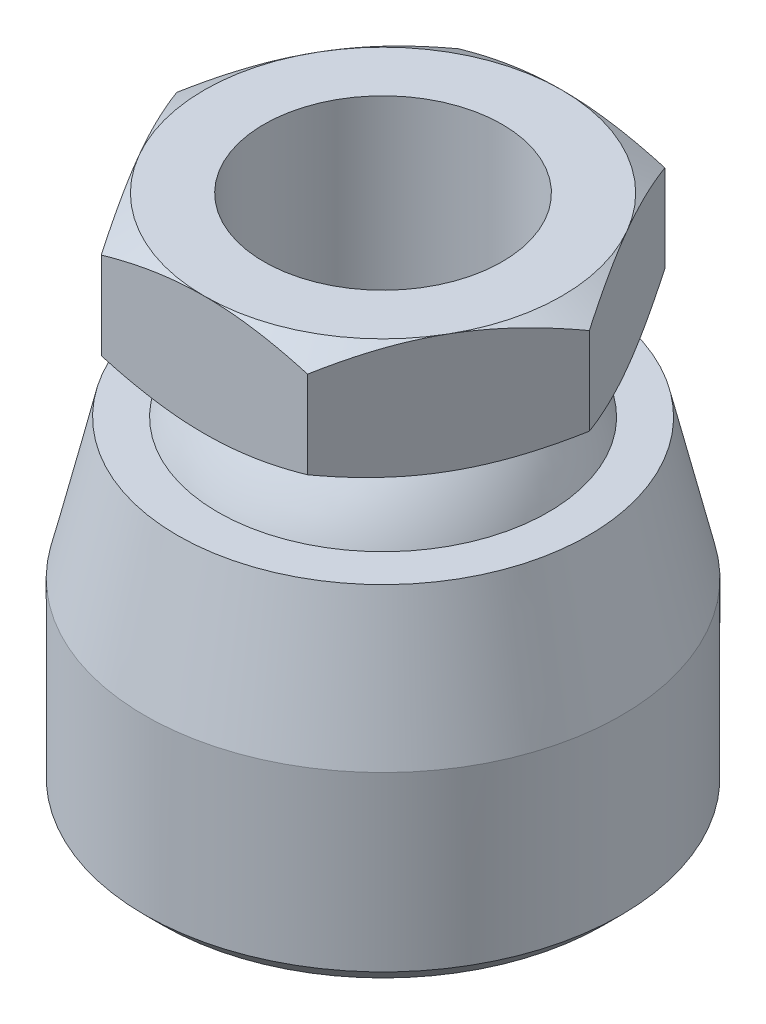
ISO-10303-21;
HEADER;
FILE_DESCRIPTION(('STEP AP214'),'2;1');
FILE_NAME('part.step','',(''),(''),'','','');
FILE_SCHEMA(('AUTOMOTIVE_DESIGN { 1 0 10303 214 1 1 1 1 }'));
ENDSEC;
DATA;
#1=APPLICATION_CONTEXT('core data for automotive mechanical design processes');
#2=APPLICATION_PROTOCOL_DEFINITION('international standard','automotive_design',2000,#1);
#3=PRODUCT_CONTEXT('',#1,'mechanical');
#4=PRODUCT('Part','Part','',(#3));
#5=PRODUCT_RELATED_PRODUCT_CATEGORY('part','',(#4));
#6=PRODUCT_DEFINITION_FORMATION('','',#4);
#7=PRODUCT_DEFINITION_CONTEXT('part definition',#1,'design');
#8=PRODUCT_DEFINITION('design','',#6,#7);
#9=PRODUCT_DEFINITION_SHAPE('','',#8);
#10=(LENGTH_UNIT() NAMED_UNIT(*) SI_UNIT(.MILLI.,.METRE.));
#11=(NAMED_UNIT(*) PLANE_ANGLE_UNIT() SI_UNIT($,.RADIAN.));
#12=(NAMED_UNIT(*) SI_UNIT($,.STERADIAN.) SOLID_ANGLE_UNIT());
#13=UNCERTAINTY_MEASURE_WITH_UNIT(LENGTH_MEASURE(1.E-05),#10,'distance_accuracy_value','');
#14=(GEOMETRIC_REPRESENTATION_CONTEXT(3) GLOBAL_UNCERTAINTY_ASSIGNED_CONTEXT((#13)) GLOBAL_UNIT_ASSIGNED_CONTEXT((#10,
#11,#12)) REPRESENTATION_CONTEXT('',''));
#15=CARTESIAN_POINT('',(0.,0.,0.));
#16=DIRECTION('',(0.,0.,1.));
#17=DIRECTION('',(1.,0.,0.));
#18=AXIS2_PLACEMENT_3D('',#15,#16,#17);
#19=CARTESIAN_POINT('',(0.,0.,0.));
#20=DIRECTION('',(-1.,0.,0.));
#21=DIRECTION('',(0.,1.,0.));
#22=AXIS2_PLACEMENT_3D('',#19,#20,#21);
#23=SPHERICAL_SURFACE('',#22,7.5);
#24=CARTESIAN_POINT('',(0.,0.,0.));
#25=DIRECTION('',(0.,-1.,0.));
#26=DIRECTION('',(0.,0.,-1.));
#27=AXIS2_PLACEMENT_3D('',#24,#25,#26);
#28=SPHERICAL_SURFACE('',#27,7.5);
#29=CARTESIAN_POINT('',(0.,4.77272727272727,0.));
#30=DIRECTION('',(0.,-1.,0.));
#31=DIRECTION('',(0.,0.,-1.));
#32=AXIS2_PLACEMENT_3D('',#29,#30,#31);
#33=CIRCLE('',#32,5.78541911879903);
#34=CARTESIAN_POINT('',(0.,4.77272727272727,-5.78541911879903));
#35=VERTEX_POINT('',#34);
#36=EDGE_CURVE('P0_E273',#35,#35,#33,.T.);
#37=ORIENTED_EDGE('',*,*,#36,.T.);
#38=EDGE_LOOP('',(#37));
#39=FACE_BOUND('',#38,.T.);
#40=ADVANCED_FACE('P0_F16',(#39),#28,.T.);
#41=CARTESIAN_POINT('',(-4.33012701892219,6.,7.5));
#42=DIRECTION('',(0.,1.,0.));
#43=DIRECTION('',(0.,0.,1.));
#44=AXIS2_PLACEMENT_3D('',#41,#42,#43);
#45=PLANE('',#44);
#46=CARTESIAN_POINT('',(0.,6.,0.));
#47=DIRECTION('',(0.,1.,0.));
#48=DIRECTION('',(0.,0.,1.));
#49=AXIS2_PLACEMENT_3D('',#46,#47,#48);
#50=CIRCLE('',#49,6.36396103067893);
#51=CARTESIAN_POINT('',(0.,6.,6.36396103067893));
#52=VERTEX_POINT('',#51);
#53=EDGE_CURVE('P0_E270',#52,#52,#50,.T.);
#54=ORIENTED_EDGE('',*,*,#53,.T.);
#55=EDGE_LOOP('',(#54));
#56=FACE_BOUND('',#55,.T.);
#57=CARTESIAN_POINT('',(0.,6.,0.));
#58=DIRECTION('',(0.,1.,0.));
#59=DIRECTION('',(0.,0.,1.));
#60=AXIS2_PLACEMENT_3D('',#57,#58,#59);
#61=CIRCLE('',#60,7.5);
#62=CARTESIAN_POINT('',(0.,6.,7.5));
#63=VERTEX_POINT('',#62);
#64=CARTESIAN_POINT('',(6.49519052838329,6.,3.75));
#65=VERTEX_POINT('',#64);
#66=EDGE_CURVE('P0_E317',#63,#65,#61,.T.);
#67=ORIENTED_EDGE('',*,*,#66,.F.);
#68=CARTESIAN_POINT('',(-6.49519052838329,6.,3.75));
#69=VERTEX_POINT('',#68);
#70=EDGE_CURVE('P0_E322',#69,#63,#61,.T.);
#71=ORIENTED_EDGE('',*,*,#70,.F.);
#72=CARTESIAN_POINT('',(-6.49519052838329,6.,-3.75));
#73=VERTEX_POINT('',#72);
#74=EDGE_CURVE('P0_E318',#73,#69,#61,.T.);
#75=ORIENTED_EDGE('',*,*,#74,.F.);
#76=CARTESIAN_POINT('',(0.,6.,-7.5));
#77=VERTEX_POINT('',#76);
#78=EDGE_CURVE('P0_E36',#77,#73,#61,.T.);
#79=ORIENTED_EDGE('',*,*,#78,.F.);
#80=CARTESIAN_POINT('',(6.49519052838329,6.,-3.75));
#81=VERTEX_POINT('',#80);
#82=EDGE_CURVE('P0_E44',#81,#77,#61,.T.);
#83=ORIENTED_EDGE('',*,*,#82,.F.);
#84=EDGE_CURVE('P0_E314',#65,#81,#61,.T.);
#85=ORIENTED_EDGE('',*,*,#84,.F.);
#86=EDGE_LOOP('',(#67,#71,#75,#79,#83,#85));
#87=FACE_BOUND('',#86,.T.);
#88=ADVANCED_FACE('P0_F132',(#56,#87),#45,.F.);
#89=CARTESIAN_POINT('',(0.,5.25,0.));
#90=DIRECTION('',(0.,1.,0.));
#91=DIRECTION('',(0.,0.,1.));
#92=AXIS2_PLACEMENT_3D('',#89,#90,#91);
#93=TOROIDAL_SURFACE('',#92,6.36396103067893,0.75);
#94=ORIENTED_EDGE('',*,*,#36,.F.);
#95=EDGE_LOOP('',(#94));
#96=FACE_BOUND('',#95,.T.);
#97=ORIENTED_EDGE('',*,*,#53,.F.);
#98=EDGE_LOOP('',(#97));
#99=FACE_BOUND('',#98,.T.);
#100=ADVANCED_FACE('P0_F18',(#96,#99),#93,.F.);
#101=CARTESIAN_POINT('',(0.,6.,0.));
#102=DIRECTION('',(0.,1.,0.));
#103=DIRECTION('',(0.,0.,1.));
#104=AXIS2_PLACEMENT_3D('',#101,#102,#103);
#105=CONICAL_SURFACE('',#104,7.5,1.0471975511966);
#106=CARTESIAN_POINT('',(-4.33001154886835,6.66993964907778,7.5002));
#107=CARTESIAN_POINT('',(-4.42519256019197,6.61499527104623,7.3353416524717));
#108=CARTESIAN_POINT('',(-4.52072845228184,6.56254448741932,7.16986863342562));
#109=CARTESIAN_POINT('',(-4.71257608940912,6.4633168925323,6.83757877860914));
#110=CARTESIAN_POINT('',(-4.80888815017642,6.41654252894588,6.67076139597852));
#111=CARTESIAN_POINT('',(-5.09936639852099,6.28565218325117,6.16763831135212));
#112=CARTESIAN_POINT('',(-5.29467919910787,6.21120330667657,5.82934661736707));
#113=CARTESIAN_POINT('',(-5.58696124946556,6.12390332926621,5.32309925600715));
#114=CARTESIAN_POINT('',(-5.68305719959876,6.09903411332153,5.15665618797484));
#115=CARTESIAN_POINT('',(-5.87568330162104,6.057332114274,4.82301799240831));
#116=CARTESIAN_POINT('',(-5.97221341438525,6.04049862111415,4.65582293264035));
#117=CARTESIAN_POINT('',(-6.16544128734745,6.01529707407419,4.32114243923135));
#118=CARTESIAN_POINT('',(-6.26213873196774,6.00691941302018,4.15365755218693));
#119=CARTESIAN_POINT('',(-6.45561760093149,5.99880018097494,3.81854232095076));
#120=CARTESIAN_POINT('',(-6.55239902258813,5.99905834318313,3.65091198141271));
#121=CARTESIAN_POINT('',(-6.81754700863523,6.01163600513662,3.19166219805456));
#122=CARTESIAN_POINT('',(-6.98582677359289,6.03274966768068,2.90019309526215));
#123=CARTESIAN_POINT('',(-7.32126860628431,6.09970057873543,2.31919079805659));
#124=CARTESIAN_POINT('',(-7.48842949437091,6.14556070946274,2.02965964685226));
#125=CARTESIAN_POINT('',(-7.82454637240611,6.26019745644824,1.44748813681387));
#126=CARTESIAN_POINT('',(-7.99345995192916,6.32945976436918,1.15492123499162));
#127=CARTESIAN_POINT('',(-8.32876816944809,6.48665715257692,0.574150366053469));
#128=CARTESIAN_POINT('',(-8.49516710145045,6.5745553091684,0.285938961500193));
#129=CARTESIAN_POINT('',(-8.66036950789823,6.66993964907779,-0.000200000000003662));
#130=B_SPLINE_CURVE_WITH_KNOTS('',3,(#106,#107,#108,#109,#110,#111,#112,#113,#114,#115,#116,
#117,#118,#119,#120,#121,#122,#123,#124,#125,#126,#127,#128,#129),.UNSPECIFIED.,.F.,.F.,(4,2,2,
2,2,2,2,2,2,2,2,4),(0.,0.594350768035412,1.1889569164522,2.38063993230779,2.96188692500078,
3.54308254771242,4.12361709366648,4.70413370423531,5.71473675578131,6.72627588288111,
7.7602492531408,8.7921928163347),.UNSPECIFIED.);
#131=CARTESIAN_POINT('',(-4.33012701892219,6.6698729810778,7.5));
#132=VERTEX_POINT('',#131);
#133=EDGE_CURVE('P0_E167',#132,#69,#130,.T.);
#134=ORIENTED_EDGE('',*,*,#133,.T.);
#135=ORIENTED_EDGE('',*,*,#70,.T.);
#136=CARTESIAN_POINT('',(-11.7399246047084,9.71300317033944,7.5));
#137=CARTESIAN_POINT('',(-11.4114312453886,9.55322055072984,7.5));
#138=CARTESIAN_POINT('',(-11.0821954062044,9.39493882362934,7.5));
#139=CARTESIAN_POINT('',(-10.4218443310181,9.08221912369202,7.5));
#140=CARTESIAN_POINT('',(-10.0907288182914,8.92778173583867,7.5));
#141=CARTESIAN_POINT('',(-9.42456940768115,8.62283875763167,7.5));
#142=CARTESIAN_POINT('',(-9.08951399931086,8.47235822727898,7.5));
#143=CARTESIAN_POINT('',(-8.41677619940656,8.17741148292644,7.5));
#144=CARTESIAN_POINT('',(-8.07909392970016,8.03294499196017,7.5));
#145=CARTESIAN_POINT('',(-7.38923768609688,7.74691375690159,7.5));
#146=CARTESIAN_POINT('',(-7.03695622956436,7.60560683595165,7.5));
#147=CARTESIAN_POINT('',(-6.32831297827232,7.33342676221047,7.5));
#148=CARTESIAN_POINT('',(-5.97195073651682,7.20255476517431,7.5));
#149=CARTESIAN_POINT('',(-5.25520733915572,6.95460120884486,7.5));
#150=CARTESIAN_POINT('',(-4.8948356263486,6.83749264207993,7.5));
#151=CARTESIAN_POINT('',(-4.16893624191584,6.62075058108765,7.5));
#152=CARTESIAN_POINT('',(-3.80341019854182,6.52111169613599,7.5));
#153=CARTESIAN_POINT('',(-3.06899464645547,6.34456276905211,7.5));
#154=CARTESIAN_POINT('',(-2.70013669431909,6.2675249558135,7.5));
#155=CARTESIAN_POINT('',(-2.14340535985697,6.17219538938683,7.5));
#156=CARTESIAN_POINT('',(-1.95724126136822,6.14378880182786,7.5));
#157=CARTESIAN_POINT('',(-1.58395123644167,6.0942724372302,7.5));
#158=CARTESIAN_POINT('',(-1.39682540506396,6.07316195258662,7.5));
#159=CARTESIAN_POINT('',(-1.02435435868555,6.03892891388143,7.5));
#160=CARTESIAN_POINT('',(-0.839018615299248,6.02570373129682,7.5));
#161=CARTESIAN_POINT('',(-0.467953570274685,6.00710797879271,7.5));
#162=CARTESIAN_POINT('',(-0.282224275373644,6.00173727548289,7.5));
#163=CARTESIAN_POINT('',(0.0892948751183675,5.99897902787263,7.5));
#164=CARTESIAN_POINT('',(0.275084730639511,6.00159147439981,7.5));
#165=CARTESIAN_POINT('',(0.646386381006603,6.01473424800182,7.5));
#166=CARTESIAN_POINT('',(0.831898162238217,6.02526495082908,7.5));
#167=CARTESIAN_POINT('',(1.27449362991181,6.05960942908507,7.5));
#168=CARTESIAN_POINT('',(1.53130595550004,6.08699966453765,7.5));
#169=CARTESIAN_POINT('',(2.04308317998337,6.15548478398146,7.5));
#170=CARTESIAN_POINT('',(2.29804783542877,6.19658144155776,7.5));
#171=CARTESIAN_POINT('',(3.05984680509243,6.33825690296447,7.5));
#172=CARTESIAN_POINT('',(3.56331481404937,6.4571972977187,7.5));
#173=CARTESIAN_POINT('',(4.31626206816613,6.66419870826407,7.5));
#174=CARTESIAN_POINT('',(4.56962704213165,6.73894547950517,7.5));
#175=CARTESIAN_POINT('',(5.07389819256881,6.89639143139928,7.5));
#176=CARTESIAN_POINT('',(5.32480435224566,6.97909066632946,7.5));
#177=CARTESIAN_POINT('',(5.82423290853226,7.15109908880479,7.5));
#178=CARTESIAN_POINT('',(6.07275601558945,7.24040623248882,7.5));
#179=CARTESIAN_POINT('',(6.56773076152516,7.4245609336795,7.5));
#180=CARTESIAN_POINT('',(6.8141824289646,7.51940841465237,7.5));
#181=CARTESIAN_POINT('',(7.41175320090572,7.75587499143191,7.5));
#182=CARTESIAN_POINT('',(7.76190417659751,7.89993661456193,7.5));
#183=CARTESIAN_POINT('',(8.45907720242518,8.1954647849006,7.5));
#184=CARTESIAN_POINT('',(8.80609902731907,8.34693186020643,7.5));
#185=CARTESIAN_POINT('',(9.49762206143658,8.65573479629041,7.5));
#186=CARTESIAN_POINT('',(9.84212259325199,8.81307216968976,7.5));
#187=CARTESIAN_POINT('',(10.5289499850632,9.13238726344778,7.5));
#188=CARTESIAN_POINT('',(10.8712768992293,9.29436486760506,7.5));
#189=CARTESIAN_POINT('',(11.5545479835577,9.62226162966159,7.5));
#190=CARTESIAN_POINT('',(11.8954899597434,9.78818535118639,7.5));
#191=CARTESIAN_POINT('',(12.5758660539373,10.1230950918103,7.5));
#192=CARTESIAN_POINT('',(12.9153001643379,10.292081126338,7.5));
#193=CARTESIAN_POINT('',(13.9316123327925,10.8027420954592,7.5));
#194=CARTESIAN_POINT('',(14.6066041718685,11.1481702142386,7.5));
#195=CARTESIAN_POINT('',(15.893399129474,11.8151110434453,7.5));
#196=CARTESIAN_POINT('',(16.505508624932,12.1360353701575,7.5));
#197=CARTESIAN_POINT('',(17.727464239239,12.7822217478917,7.5));
#198=CARTESIAN_POINT('',(18.3373102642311,13.107483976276,7.5));
#199=CARTESIAN_POINT('',(19.553576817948,13.7603963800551,7.5));
#200=CARTESIAN_POINT('',(20.1600021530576,14.0880376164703,7.5));
#201=CARTESIAN_POINT('',(21.371414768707,14.7458814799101,7.5));
#202=CARTESIAN_POINT('',(21.9764021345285,15.07608394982,7.5));
#203=CARTESIAN_POINT('',(22.5808653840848,15.4072366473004,7.5));
#204=B_SPLINE_CURVE_WITH_KNOTS('',3,(#136,#137,#138,#139,#140,#141,#142,#143,#144,#145,#146,
#147,#148,#149,#150,#151,#152,#153,#154,#155,#156,#157,#158,#159,#160,#161,#162,#163,#164,#165,
#166,#167,#168,#169,#170,#171,#172,#173,#174,#175,#176,#177,#178,#179,#180,#181,#182,#183,#184,
#185,#186,#187,#188,#189,#190,#191,#192,#193,#194,#195,#196,#197,#198,#199,#200,#201,#202,#203),
.UNSPECIFIED.,.F.,.F.,(4,2,2,2,2,2,2,2,2,2,2,2,2,2,2,2,2,2,2,2,2,2,2,2,2,2,2,2,2,2,2,2,2,4),(0.,
1.0958893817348,2.19194451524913,3.29378576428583,4.39557621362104,5.53414396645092,
6.67283765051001,7.80925823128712,8.94532752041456,10.0748446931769,10.6396809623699,
11.204462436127,11.7617229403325,12.3189739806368,12.8762243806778,13.4335012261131,
14.2078723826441,14.9823437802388,16.5320999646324,17.3245132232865,18.1169318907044,
18.9091064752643,19.7012701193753,20.8370379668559,21.9728869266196,23.1090306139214,
24.2451458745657,25.3826459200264,26.5201516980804,28.7948168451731,30.8682096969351,
32.9416875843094,35.0095069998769,37.0772005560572),.UNSPECIFIED.);
#205=EDGE_CURVE('P0_E20',#63,#132,#204,.F.);
#206=ORIENTED_EDGE('',*,*,#205,.T.);
#207=EDGE_LOOP('',(#134,#135,#206));
#208=FACE_BOUND('',#207,.T.);
#209=ADVANCED_FACE('P0_F181',(#208),#105,.T.);
#210=CARTESIAN_POINT('',(8.66036950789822,6.66993964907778,-0.000199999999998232));
#211=CARTESIAN_POINT('',(8.5651884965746,6.61499527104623,0.164658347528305));
#212=CARTESIAN_POINT('',(8.46965260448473,6.56254448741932,0.330131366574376));
#213=CARTESIAN_POINT('',(8.27780496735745,6.4633168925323,0.662421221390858));
#214=CARTESIAN_POINT('',(8.18149290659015,6.41654252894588,0.829238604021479));
#215=CARTESIAN_POINT('',(7.89101465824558,6.28565218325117,1.33236168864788));
#216=CARTESIAN_POINT('',(7.6957018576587,6.21120330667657,1.67065338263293));
#217=CARTESIAN_POINT('',(7.40341980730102,6.12390332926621,2.17690074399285));
#218=CARTESIAN_POINT('',(7.30732385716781,6.09903411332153,2.34334381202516));
#219=CARTESIAN_POINT('',(7.11469775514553,6.05733211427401,2.6769820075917));
#220=CARTESIAN_POINT('',(7.01816764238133,6.04049862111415,2.84417706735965));
#221=CARTESIAN_POINT('',(6.82493976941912,6.01529707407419,3.17885756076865));
#222=CARTESIAN_POINT('',(6.72824232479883,6.00691941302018,3.34634244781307));
#223=CARTESIAN_POINT('',(6.53476345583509,5.99880018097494,3.68145767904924));
#224=CARTESIAN_POINT('',(6.43798203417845,5.99905834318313,3.84908801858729));
#225=CARTESIAN_POINT('',(6.17283404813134,6.01163600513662,4.30833780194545));
#226=CARTESIAN_POINT('',(6.00455428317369,6.03274966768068,4.59980690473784));
#227=CARTESIAN_POINT('',(5.66911245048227,6.09970057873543,5.18080920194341));
#228=CARTESIAN_POINT('',(5.50195156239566,6.14556070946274,5.47034035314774));
#229=CARTESIAN_POINT('',(5.16583468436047,6.26019745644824,6.05251186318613));
#230=CARTESIAN_POINT('',(4.99692110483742,6.32945976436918,6.34507876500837));
#231=CARTESIAN_POINT('',(4.66161288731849,6.48665715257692,6.92584963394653));
#232=CARTESIAN_POINT('',(4.49521395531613,6.5745553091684,7.2140610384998));
#233=CARTESIAN_POINT('',(4.33001154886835,6.66993964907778,7.5002));
#234=B_SPLINE_CURVE_WITH_KNOTS('',3,(#210,#211,#212,#213,#214,#215,#216,#217,#218,#219,#220,
#221,#222,#223,#224,#225,#226,#227,#228,#229,#230,#231,#232,#233),.UNSPECIFIED.,.F.,.F.,(4,2,2,
2,2,2,2,2,2,2,2,4),(0.,0.594350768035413,1.1889569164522,2.38063993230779,2.96188692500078,
3.54308254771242,4.12361709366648,4.70413370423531,5.7147367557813,6.7262758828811,
7.7602492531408,8.79219281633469),.UNSPECIFIED.);
#235=CARTESIAN_POINT('',(4.33012701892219,6.6698729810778,7.5));
#236=VERTEX_POINT('',#235);
#237=EDGE_CURVE('P0_E189',#65,#236,#234,.T.);
#238=ORIENTED_EDGE('',*,*,#237,.T.);
#239=EDGE_CURVE('P0_E11',#236,#63,#204,.F.);
#240=ORIENTED_EDGE('',*,*,#239,.T.);
#241=ORIENTED_EDGE('',*,*,#66,.T.);
#242=EDGE_LOOP('',(#238,#240,#241));
#243=FACE_BOUND('',#242,.T.);
#244=ADVANCED_FACE('P0_F177',(#243),#105,.T.);
#245=CARTESIAN_POINT('',(4.33001154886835,6.66993964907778,-7.5002));
#246=CARTESIAN_POINT('',(4.42519256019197,6.61499527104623,-7.3353416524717));
#247=CARTESIAN_POINT('',(4.52072845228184,6.56254448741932,-7.16986863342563));
#248=CARTESIAN_POINT('',(4.71257608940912,6.4633168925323,-6.83757877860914));
#249=CARTESIAN_POINT('',(4.80888815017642,6.41654252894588,-6.67076139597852));
#250=CARTESIAN_POINT('',(5.09936639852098,6.28565218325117,-6.16763831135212));
#251=CARTESIAN_POINT('',(5.29467919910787,6.21120330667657,-5.82934661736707));
#252=CARTESIAN_POINT('',(5.58696124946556,6.12390332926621,-5.32309925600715));
#253=CARTESIAN_POINT('',(5.68305719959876,6.09903411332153,-5.15665618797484));
#254=CARTESIAN_POINT('',(5.87568330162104,6.057332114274,-4.82301799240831));
#255=CARTESIAN_POINT('',(5.97221341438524,6.04049862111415,-4.65582293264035));
#256=CARTESIAN_POINT('',(6.16544128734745,6.01529707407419,-4.32114243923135));
#257=CARTESIAN_POINT('',(6.26213873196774,6.00691941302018,-4.15365755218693));
#258=CARTESIAN_POINT('',(6.45561760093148,5.99880018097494,-3.81854232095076));
#259=CARTESIAN_POINT('',(6.55239902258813,5.99905834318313,-3.65091198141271));
#260=CARTESIAN_POINT('',(6.81754700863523,6.01163600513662,-3.19166219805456));
#261=CARTESIAN_POINT('',(6.98582677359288,6.03274966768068,-2.90019309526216));
#262=CARTESIAN_POINT('',(7.32126860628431,6.09970057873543,-2.31919079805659));
#263=CARTESIAN_POINT('',(7.48842949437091,6.14556070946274,-2.02965964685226));
#264=CARTESIAN_POINT('',(7.8245463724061,6.26019745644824,-1.44748813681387));
#265=CARTESIAN_POINT('',(7.99345995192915,6.32945976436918,-1.15492123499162));
#266=CARTESIAN_POINT('',(8.32876816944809,6.48665715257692,-0.57415036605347));
#267=CARTESIAN_POINT('',(8.49516710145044,6.5745553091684,-0.285938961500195));
#268=CARTESIAN_POINT('',(8.66036950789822,6.66993964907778,0.000200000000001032));
#269=B_SPLINE_CURVE_WITH_KNOTS('',3,(#245,#246,#247,#248,#249,#250,#251,#252,#253,#254,#255,
#256,#257,#258,#259,#260,#261,#262,#263,#264,#265,#266,#267,#268),.UNSPECIFIED.,.F.,.F.,(4,2,2,
2,2,2,2,2,2,2,2,4),(0.,0.594350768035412,1.1889569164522,2.38063993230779,2.96188692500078,
3.54308254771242,4.12361709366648,4.70413370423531,5.71473675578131,6.72627588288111,
7.7602492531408,8.79219281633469),.UNSPECIFIED.);
#270=CARTESIAN_POINT('',(8.66025403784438,6.6698729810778,0.));
#271=VERTEX_POINT('',#270);
#272=EDGE_CURVE('P0_E196',#81,#271,#269,.T.);
#273=ORIENTED_EDGE('',*,*,#272,.T.);
#274=EDGE_CURVE('P0_E304',#271,#65,#234,.T.);
#275=ORIENTED_EDGE('',*,*,#274,.T.);
#276=ORIENTED_EDGE('',*,*,#84,.T.);
#277=EDGE_LOOP('',(#273,#275,#276));
#278=FACE_BOUND('',#277,.T.);
#279=ADVANCED_FACE('P0_F180',(#278),#105,.T.);
#280=CARTESIAN_POINT('',(-11.7399246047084,9.71300317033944,-7.5));
#281=CARTESIAN_POINT('',(-11.4114312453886,9.55322055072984,-7.5));
#282=CARTESIAN_POINT('',(-11.0821954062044,9.39493882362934,-7.5));
#283=CARTESIAN_POINT('',(-10.4218443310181,9.08221912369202,-7.5));
#284=CARTESIAN_POINT('',(-10.0907288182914,8.92778173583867,-7.5));
#285=CARTESIAN_POINT('',(-9.42456940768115,8.62283875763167,-7.5));
#286=CARTESIAN_POINT('',(-9.08951399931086,8.47235822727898,-7.5));
#287=CARTESIAN_POINT('',(-8.41677619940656,8.17741148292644,-7.5));
#288=CARTESIAN_POINT('',(-8.07909392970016,8.03294499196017,-7.5));
#289=CARTESIAN_POINT('',(-7.38923768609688,7.74691375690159,-7.5));
#290=CARTESIAN_POINT('',(-7.03695622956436,7.60560683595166,-7.5));
#291=CARTESIAN_POINT('',(-6.32831297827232,7.33342676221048,-7.5));
#292=CARTESIAN_POINT('',(-5.97195073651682,7.20255476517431,-7.5));
#293=CARTESIAN_POINT('',(-5.25520733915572,6.95460120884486,-7.5));
#294=CARTESIAN_POINT('',(-4.8948356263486,6.83749264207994,-7.5));
#295=CARTESIAN_POINT('',(-4.16893624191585,6.62075058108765,-7.5));
#296=CARTESIAN_POINT('',(-3.80341019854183,6.52111169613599,-7.5));
#297=CARTESIAN_POINT('',(-3.06899464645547,6.34456276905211,-7.5));
#298=CARTESIAN_POINT('',(-2.70013669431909,6.26752495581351,-7.5));
#299=CARTESIAN_POINT('',(-2.14340535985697,6.17219538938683,-7.5));
#300=CARTESIAN_POINT('',(-1.95724126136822,6.14378880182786,-7.5));
#301=CARTESIAN_POINT('',(-1.58395123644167,6.0942724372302,-7.5));
#302=CARTESIAN_POINT('',(-1.39682540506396,6.07316195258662,-7.5));
#303=CARTESIAN_POINT('',(-1.02435435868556,6.03892891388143,-7.5));
#304=CARTESIAN_POINT('',(-0.839018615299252,6.02570373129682,-7.5));
#305=CARTESIAN_POINT('',(-0.467953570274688,6.00710797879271,-7.5));
#306=CARTESIAN_POINT('',(-0.282224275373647,6.00173727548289,-7.5));
#307=CARTESIAN_POINT('',(0.0892948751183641,5.99897902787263,-7.5));
#308=CARTESIAN_POINT('',(0.275084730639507,6.00159147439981,-7.5));
#309=CARTESIAN_POINT('',(0.646386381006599,6.01473424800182,-7.5));
#310=CARTESIAN_POINT('',(0.831898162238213,6.02526495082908,-7.5));
#311=CARTESIAN_POINT('',(1.2744936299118,6.05960942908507,-7.5));
#312=CARTESIAN_POINT('',(1.53130595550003,6.08699966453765,-7.5));
#313=CARTESIAN_POINT('',(2.04308317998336,6.15548478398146,-7.5));
#314=CARTESIAN_POINT('',(2.29804783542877,6.19658144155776,-7.5));
#315=CARTESIAN_POINT('',(3.05984680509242,6.33825690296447,-7.5));
#316=CARTESIAN_POINT('',(3.56331481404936,6.4571972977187,-7.5));
#317=CARTESIAN_POINT('',(4.31626206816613,6.66419870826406,-7.5));
#318=CARTESIAN_POINT('',(4.56962704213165,6.73894547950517,-7.5));
#319=CARTESIAN_POINT('',(5.07389819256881,6.89639143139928,-7.5));
#320=CARTESIAN_POINT('',(5.32480435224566,6.97909066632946,-7.5));
#321=CARTESIAN_POINT('',(5.82423290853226,7.15109908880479,-7.5));
#322=CARTESIAN_POINT('',(6.07275601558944,7.24040623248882,-7.5));
#323=CARTESIAN_POINT('',(6.56773076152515,7.4245609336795,-7.5));
#324=CARTESIAN_POINT('',(6.8141824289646,7.51940841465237,-7.5));
#325=CARTESIAN_POINT('',(7.41175320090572,7.7558749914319,-7.5));
#326=CARTESIAN_POINT('',(7.7619041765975,7.89993661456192,-7.5));
#327=CARTESIAN_POINT('',(8.45907720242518,8.1954647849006,-7.5));
#328=CARTESIAN_POINT('',(8.80609902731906,8.34693186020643,-7.5));
#329=CARTESIAN_POINT('',(9.49762206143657,8.65573479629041,-7.5));
#330=CARTESIAN_POINT('',(9.84212259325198,8.81307216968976,-7.5));
#331=CARTESIAN_POINT('',(10.5289499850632,9.13238726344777,-7.5));
#332=CARTESIAN_POINT('',(10.8712768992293,9.29436486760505,-7.5));
#333=CARTESIAN_POINT('',(11.5545479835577,9.62226162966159,-7.5));
#334=CARTESIAN_POINT('',(11.8954899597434,9.78818535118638,-7.5));
#335=CARTESIAN_POINT('',(12.5758660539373,10.1230950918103,-7.5));
#336=CARTESIAN_POINT('',(12.9153001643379,10.292081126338,-7.5));
#337=CARTESIAN_POINT('',(13.9316123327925,10.8027420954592,-7.5));
#338=CARTESIAN_POINT('',(14.6066041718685,11.1481702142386,-7.5));
#339=CARTESIAN_POINT('',(15.893399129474,11.8151110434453,-7.5));
#340=CARTESIAN_POINT('',(16.505508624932,12.1360353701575,-7.5));
#341=CARTESIAN_POINT('',(17.727464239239,12.7822217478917,-7.5));
#342=CARTESIAN_POINT('',(18.3373102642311,13.107483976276,-7.5));
#343=CARTESIAN_POINT('',(19.553576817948,13.7603963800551,-7.5));
#344=CARTESIAN_POINT('',(20.1600021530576,14.0880376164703,-7.5));
#345=CARTESIAN_POINT('',(21.371414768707,14.7458814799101,-7.5));
#346=CARTESIAN_POINT('',(21.9764021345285,15.07608394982,-7.5));
#347=CARTESIAN_POINT('',(22.5808653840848,15.4072366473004,-7.5));
#348=B_SPLINE_CURVE_WITH_KNOTS('',3,(#280,#281,#282,#283,#284,#285,#286,#287,#288,#289,#290,
#291,#292,#293,#294,#295,#296,#297,#298,#299,#300,#301,#302,#303,#304,#305,#306,#307,#308,#309,
#310,#311,#312,#313,#314,#315,#316,#317,#318,#319,#320,#321,#322,#323,#324,#325,#326,#327,#328,
#329,#330,#331,#332,#333,#334,#335,#336,#337,#338,#339,#340,#341,#342,#343,#344,#345,#346,#347),
.UNSPECIFIED.,.F.,.F.,(4,2,2,2,2,2,2,2,2,2,2,2,2,2,2,2,2,2,2,2,2,2,2,2,2,2,2,2,2,2,2,2,2,4),(0.,
1.0958893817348,2.19194451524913,3.29378576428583,4.39557621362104,5.53414396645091,
6.67283765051,7.80925823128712,8.94532752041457,10.0748446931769,10.6396809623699,
11.204462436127,11.7617229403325,12.3189739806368,12.8762243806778,13.4335012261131,
14.2078723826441,14.9823437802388,16.5320999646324,17.3245132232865,18.1169318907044,
18.9091064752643,19.7012701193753,20.8370379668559,21.9728869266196,23.1090306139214,
24.2451458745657,25.3826459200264,26.5201516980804,28.7948168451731,30.8682096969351,
32.9416875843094,35.0095069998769,37.0772005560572),.UNSPECIFIED.);
#349=CARTESIAN_POINT('',(4.33012701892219,6.6698729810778,-7.5));
#350=VERTEX_POINT('',#349);
#351=EDGE_CURVE('P0_E201',#77,#350,#348,.T.);
#352=ORIENTED_EDGE('',*,*,#351,.T.);
#353=EDGE_CURVE('P0_E207',#350,#81,#269,.T.);
#354=ORIENTED_EDGE('',*,*,#353,.T.);
#355=ORIENTED_EDGE('',*,*,#82,.T.);
#356=EDGE_LOOP('',(#352,#354,#355));
#357=FACE_BOUND('',#356,.T.);
#358=ADVANCED_FACE('P0_F310',(#357),#105,.T.);
#359=CARTESIAN_POINT('',(-8.66036950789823,6.66993964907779,0.000199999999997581));
#360=CARTESIAN_POINT('',(-8.56518849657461,6.61499527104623,-0.164658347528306));
#361=CARTESIAN_POINT('',(-8.46965260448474,6.56254448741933,-0.330131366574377));
#362=CARTESIAN_POINT('',(-8.27780496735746,6.4633168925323,-0.662421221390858));
#363=CARTESIAN_POINT('',(-8.18149290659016,6.41654252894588,-0.82923860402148));
#364=CARTESIAN_POINT('',(-7.89101465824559,6.28565218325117,-1.33236168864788));
#365=CARTESIAN_POINT('',(-7.69570185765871,6.21120330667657,-1.67065338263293));
#366=CARTESIAN_POINT('',(-7.40341980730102,6.12390332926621,-2.17690074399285));
#367=CARTESIAN_POINT('',(-7.30732385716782,6.09903411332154,-2.34334381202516));
#368=CARTESIAN_POINT('',(-7.11469775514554,6.05733211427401,-2.6769820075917));
#369=CARTESIAN_POINT('',(-7.01816764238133,6.04049862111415,-2.84417706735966));
#370=CARTESIAN_POINT('',(-6.82493976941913,6.01529707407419,-3.17885756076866));
#371=CARTESIAN_POINT('',(-6.72824232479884,6.00691941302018,-3.34634244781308));
#372=CARTESIAN_POINT('',(-6.53476345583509,5.99880018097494,-3.68145767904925));
#373=CARTESIAN_POINT('',(-6.43798203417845,5.99905834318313,-3.8490880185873));
#374=CARTESIAN_POINT('',(-6.17283404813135,6.01163600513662,-4.30833780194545));
#375=CARTESIAN_POINT('',(-6.00455428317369,6.03274966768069,-4.59980690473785));
#376=CARTESIAN_POINT('',(-5.66911245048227,6.09970057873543,-5.18080920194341));
#377=CARTESIAN_POINT('',(-5.50195156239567,6.14556070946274,-5.47034035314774));
#378=CARTESIAN_POINT('',(-5.16583468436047,6.26019745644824,-6.05251186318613));
#379=CARTESIAN_POINT('',(-4.99692110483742,6.32945976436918,-6.34507876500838));
#380=CARTESIAN_POINT('',(-4.66161288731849,6.48665715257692,-6.92584963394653));
#381=CARTESIAN_POINT('',(-4.49521395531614,6.5745553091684,-7.2140610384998));
#382=CARTESIAN_POINT('',(-4.33001154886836,6.66993964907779,-7.5002));
#383=B_SPLINE_CURVE_WITH_KNOTS('',3,(#359,#360,#361,#362,#363,#364,#365,#366,#367,#368,#369,
#370,#371,#372,#373,#374,#375,#376,#377,#378,#379,#380,#381,#382),.UNSPECIFIED.,.F.,.F.,(4,2,2,
2,2,2,2,2,2,2,2,4),(0.,0.594350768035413,1.1889569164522,2.38063993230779,2.96188692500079,
3.54308254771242,4.12361709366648,4.70413370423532,5.71473675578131,6.72627588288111,
7.7602492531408,8.79219281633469),.UNSPECIFIED.);
#384=CARTESIAN_POINT('',(-4.3301270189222,6.6698729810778,-7.5));
#385=VERTEX_POINT('',#384);
#386=EDGE_CURVE('P0_E169',#73,#385,#383,.T.);
#387=ORIENTED_EDGE('',*,*,#386,.T.);
#388=EDGE_CURVE('P0_E206',#385,#77,#348,.T.);
#389=ORIENTED_EDGE('',*,*,#388,.T.);
#390=ORIENTED_EDGE('',*,*,#78,.T.);
#391=EDGE_LOOP('',(#387,#389,#390));
#392=FACE_BOUND('',#391,.T.);
#393=ADVANCED_FACE('P0_F437',(#392),#105,.T.);
#394=CARTESIAN_POINT('',(-8.66025403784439,6.66987298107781,0.));
#395=VERTEX_POINT('',#394);
#396=EDGE_CURVE('P0_E161',#69,#395,#130,.T.);
#397=ORIENTED_EDGE('',*,*,#396,.T.);
#398=EDGE_CURVE('P0_E168',#395,#73,#383,.T.);
#399=ORIENTED_EDGE('',*,*,#398,.T.);
#400=ORIENTED_EDGE('',*,*,#74,.T.);
#401=EDGE_LOOP('',(#397,#399,#400));
#402=FACE_BOUND('',#401,.T.);
#403=ADVANCED_FACE('P0_F341',(#402),#105,.T.);
#404=CARTESIAN_POINT('',(-4.33012701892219,6.,7.5));
#405=DIRECTION('',(0.,0.,1.));
#406=DIRECTION('',(1.,0.,0.));
#407=AXIS2_PLACEMENT_3D('',#404,#405,#406);
#408=PLANE('',#407);
#409=CARTESIAN_POINT('',(-11.7399246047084,7.28699682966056,7.5));
#410=CARTESIAN_POINT('',(-11.4114312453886,7.44677944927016,7.5));
#411=CARTESIAN_POINT('',(-11.0821954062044,7.60506117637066,7.5));
#412=CARTESIAN_POINT('',(-10.4218443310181,7.91778087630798,7.5));
#413=CARTESIAN_POINT('',(-10.0907288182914,8.07221826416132,7.5));
#414=CARTESIAN_POINT('',(-9.42456940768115,8.37716124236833,7.5));
#415=CARTESIAN_POINT('',(-9.08951399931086,8.52764177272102,7.5));
#416=CARTESIAN_POINT('',(-8.41677619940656,8.82258851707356,7.5));
#417=CARTESIAN_POINT('',(-8.07909392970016,8.96705500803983,7.5));
#418=CARTESIAN_POINT('',(-7.38923768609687,9.25308624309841,7.5));
#419=CARTESIAN_POINT('',(-7.03695622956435,9.39439316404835,7.5));
#420=CARTESIAN_POINT('',(-6.32831297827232,9.66657323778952,7.5));
#421=CARTESIAN_POINT('',(-5.97195073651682,9.79744523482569,7.5));
#422=CARTESIAN_POINT('',(-5.25520733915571,10.0453987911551,7.5));
#423=CARTESIAN_POINT('',(-4.8948356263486,10.1625073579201,7.5));
#424=CARTESIAN_POINT('',(-4.16893624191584,10.3792494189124,7.5));
#425=CARTESIAN_POINT('',(-3.80341019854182,10.478888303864,7.5));
#426=CARTESIAN_POINT('',(-3.06899464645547,10.6554372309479,7.5));
#427=CARTESIAN_POINT('',(-2.70013669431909,10.7324750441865,7.5));
#428=CARTESIAN_POINT('',(-2.14340535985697,10.8278046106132,7.5));
#429=CARTESIAN_POINT('',(-1.95724126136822,10.8562111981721,7.5));
#430=CARTESIAN_POINT('',(-1.58395123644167,10.9057275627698,7.5));
#431=CARTESIAN_POINT('',(-1.39682540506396,10.9268380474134,7.5));
#432=CARTESIAN_POINT('',(-1.02435435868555,10.9610710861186,7.5));
#433=CARTESIAN_POINT('',(-0.839018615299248,10.9742962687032,7.5));
#434=CARTESIAN_POINT('',(-0.467953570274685,10.9928920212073,7.5));
#435=CARTESIAN_POINT('',(-0.282224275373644,10.9982627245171,7.5));
#436=CARTESIAN_POINT('',(0.0892948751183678,11.0010209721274,7.5));
#437=CARTESIAN_POINT('',(0.275084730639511,10.9984085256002,7.5));
#438=CARTESIAN_POINT('',(0.646386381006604,10.9852657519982,7.5));
#439=CARTESIAN_POINT('',(0.831898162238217,10.9747350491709,7.5));
#440=CARTESIAN_POINT('',(1.27449362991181,10.9403905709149,7.5));
#441=CARTESIAN_POINT('',(1.53130595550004,10.9130003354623,7.5));
#442=CARTESIAN_POINT('',(2.04308317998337,10.8445152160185,7.5));
#443=CARTESIAN_POINT('',(2.29804783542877,10.8034185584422,7.5));
#444=CARTESIAN_POINT('',(3.05984680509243,10.6617430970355,7.5));
#445=CARTESIAN_POINT('',(3.56331481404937,10.5428027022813,7.5));
#446=CARTESIAN_POINT('',(4.31626206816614,10.3358012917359,7.5));
#447=CARTESIAN_POINT('',(4.56962704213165,10.2610545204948,7.5));
#448=CARTESIAN_POINT('',(5.07389819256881,10.1036085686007,7.5));
#449=CARTESIAN_POINT('',(5.32480435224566,10.0209093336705,7.5));
#450=CARTESIAN_POINT('',(5.82423290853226,9.84890091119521,7.5));
#451=CARTESIAN_POINT('',(6.07275601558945,9.75959376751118,7.5));
#452=CARTESIAN_POINT('',(6.56773076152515,9.5754390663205,7.5));
#453=CARTESIAN_POINT('',(6.8141824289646,9.48059158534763,7.5));
#454=CARTESIAN_POINT('',(7.41175320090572,9.24412500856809,7.5));
#455=CARTESIAN_POINT('',(7.76190417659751,9.10006338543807,7.5));
#456=CARTESIAN_POINT('',(8.45907720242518,8.8045352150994,7.5));
#457=CARTESIAN_POINT('',(8.80609902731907,8.65306813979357,7.5));
#458=CARTESIAN_POINT('',(9.49762206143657,8.34426520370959,7.5));
#459=CARTESIAN_POINT('',(9.84212259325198,8.18692783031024,7.5));
#460=CARTESIAN_POINT('',(10.5289499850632,7.86761273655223,7.5));
#461=CARTESIAN_POINT('',(10.8712768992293,7.70563513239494,7.5));
#462=CARTESIAN_POINT('',(11.5545479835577,7.37773837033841,7.5));
#463=CARTESIAN_POINT('',(11.8954899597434,7.21181464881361,7.5));
#464=CARTESIAN_POINT('',(12.5758660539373,6.87690490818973,7.5));
#465=CARTESIAN_POINT('',(12.9153001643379,6.70791887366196,7.5));
#466=CARTESIAN_POINT('',(13.9316123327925,6.19725790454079,7.5));
#467=CARTESIAN_POINT('',(14.6066041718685,5.85182978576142,7.5));
#468=CARTESIAN_POINT('',(15.893399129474,5.18488895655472,7.5));
#469=CARTESIAN_POINT('',(16.505508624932,4.86396462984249,7.5));
#470=CARTESIAN_POINT('',(17.727464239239,4.21777825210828,7.5));
#471=CARTESIAN_POINT('',(18.337310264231,3.89251602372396,7.5));
#472=CARTESIAN_POINT('',(19.553576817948,3.2396036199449,7.5));
#473=CARTESIAN_POINT('',(20.1600021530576,2.91196238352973,7.5));
#474=CARTESIAN_POINT('',(21.371414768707,2.2541185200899,7.5));
#475=CARTESIAN_POINT('',(21.9764021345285,1.92391605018,7.5));
#476=CARTESIAN_POINT('',(22.5808653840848,1.59276335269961,7.5));
#477=B_SPLINE_CURVE_WITH_KNOTS('',3,(#409,#410,#411,#412,#413,#414,#415,#416,#417,#418,#419,
#420,#421,#422,#423,#424,#425,#426,#427,#428,#429,#430,#431,#432,#433,#434,#435,#436,#437,#438,
#439,#440,#441,#442,#443,#444,#445,#446,#447,#448,#449,#450,#451,#452,#453,#454,#455,#456,#457,
#458,#459,#460,#461,#462,#463,#464,#465,#466,#467,#468,#469,#470,#471,#472,#473,#474,#475,#476),
.UNSPECIFIED.,.F.,.F.,(4,2,2,2,2,2,2,2,2,2,2,2,2,2,2,2,2,2,2,2,2,2,2,2,2,2,2,2,2,2,2,2,2,4),(0.,
1.0958893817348,2.19194451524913,3.29378576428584,4.39557621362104,5.53414396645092,
6.67283765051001,7.80925823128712,8.94532752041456,10.0748446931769,10.6396809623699,
11.204462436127,11.7617229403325,12.3189739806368,12.8762243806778,13.4335012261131,
14.2078723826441,14.9823437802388,16.5320999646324,17.3245132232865,18.1169318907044,
18.9091064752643,19.7012701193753,20.8370379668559,21.9728869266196,23.1090306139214,
24.2451458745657,25.3826459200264,26.5201516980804,28.794816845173,30.8682096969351,
32.9416875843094,35.0095069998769,37.0772005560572),.UNSPECIFIED.);
#478=CARTESIAN_POINT('',(-4.33012701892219,10.3301270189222,7.5));
#479=VERTEX_POINT('',#478);
#480=CARTESIAN_POINT('',(0.,11.,7.5));
#481=VERTEX_POINT('',#480);
#482=EDGE_CURVE('P0_E327',#479,#481,#477,.T.);
#483=ORIENTED_EDGE('',*,*,#482,.F.);
#484=DIRECTION('',(0.,1.,0.));
#485=VECTOR('',#484,1.);
#486=CARTESIAN_POINT('',(-4.33012701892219,6.,7.5));
#487=LINE('',#486,#485);
#488=EDGE_CURVE('P0_E286',#132,#479,#487,.T.);
#489=ORIENTED_EDGE('',*,*,#488,.F.);
#490=ORIENTED_EDGE('',*,*,#205,.F.);
#491=ORIENTED_EDGE('',*,*,#239,.F.);
#492=DIRECTION('',(0.,1.,0.));
#493=VECTOR('',#492,1.);
#494=CARTESIAN_POINT('',(4.33012701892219,6.,7.5));
#495=LINE('',#494,#493);
#496=CARTESIAN_POINT('',(4.33012701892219,10.3301270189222,7.5));
#497=VERTEX_POINT('',#496);
#498=EDGE_CURVE('P0_E283',#236,#497,#495,.T.);
#499=ORIENTED_EDGE('',*,*,#498,.T.);
#500=EDGE_CURVE('P0_E321',#481,#497,#477,.T.);
#501=ORIENTED_EDGE('',*,*,#500,.F.);
#502=EDGE_LOOP('',(#483,#489,#490,#491,#499,#501));
#503=FACE_BOUND('',#502,.T.);
#504=ADVANCED_FACE('P0_F148',(#503),#408,.T.);
#505=CARTESIAN_POINT('',(4.33012701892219,6.,7.5));
#506=DIRECTION('',(0.866025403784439,0.,0.5));
#507=DIRECTION('',(0.5,0.,-0.866025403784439));
#508=AXIS2_PLACEMENT_3D('',#505,#506,#507);
#509=PLANE('',#508);
#510=CARTESIAN_POINT('',(4.33001154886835,10.3300603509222,7.5002));
#511=CARTESIAN_POINT('',(4.42519256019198,10.3850047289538,7.3353416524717));
#512=CARTESIAN_POINT('',(4.52072845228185,10.4374555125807,7.16986863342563));
#513=CARTESIAN_POINT('',(4.71257608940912,10.5366831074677,6.83757877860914));
#514=CARTESIAN_POINT('',(4.80888815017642,10.5834574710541,6.67076139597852));
#515=CARTESIAN_POINT('',(5.09936639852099,10.7143478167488,6.16763831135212));
#516=CARTESIAN_POINT('',(5.29467919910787,10.7887966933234,5.82934661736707));
#517=CARTESIAN_POINT('',(5.58696124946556,10.8760966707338,5.32309925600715));
#518=CARTESIAN_POINT('',(5.68305719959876,10.9009658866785,5.15665618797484));
#519=CARTESIAN_POINT('',(5.87568330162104,10.942667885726,4.8230179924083));
#520=CARTESIAN_POINT('',(5.97221341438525,10.9595013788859,4.65582293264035));
#521=CARTESIAN_POINT('',(6.16544128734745,10.9847029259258,4.32114243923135));
#522=CARTESIAN_POINT('',(6.26213873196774,10.9930805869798,4.15365755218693));
#523=CARTESIAN_POINT('',(6.45561760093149,11.0011998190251,3.81854232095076));
#524=CARTESIAN_POINT('',(6.55239902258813,11.0009416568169,3.65091198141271));
#525=CARTESIAN_POINT('',(6.81754700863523,10.9883639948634,3.19166219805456));
#526=CARTESIAN_POINT('',(6.98582677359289,10.9672503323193,2.90019309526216));
#527=CARTESIAN_POINT('',(7.32126860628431,10.9002994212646,2.31919079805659));
#528=CARTESIAN_POINT('',(7.48842949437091,10.8544392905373,2.02965964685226));
#529=CARTESIAN_POINT('',(7.8245463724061,10.7398025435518,1.44748813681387));
#530=CARTESIAN_POINT('',(7.99345995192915,10.6705402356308,1.15492123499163));
#531=CARTESIAN_POINT('',(8.32876816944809,10.5133428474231,0.574150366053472));
#532=CARTESIAN_POINT('',(8.49516710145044,10.4254446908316,0.285938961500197));
#533=CARTESIAN_POINT('',(8.66036950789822,10.3300603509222,-0.000199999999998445));
#534=B_SPLINE_CURVE_WITH_KNOTS('',3,(#510,#511,#512,#513,#514,#515,#516,#517,#518,#519,#520,
#521,#522,#523,#524,#525,#526,#527,#528,#529,#530,#531,#532,#533),.UNSPECIFIED.,.F.,.F.,(4,2,2,
2,2,2,2,2,2,2,2,4),(0.,0.594350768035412,1.1889569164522,2.38063993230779,2.96188692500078,
3.54308254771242,4.12361709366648,4.70413370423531,5.71473675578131,6.7262758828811,
7.7602492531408,8.79219281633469),.UNSPECIFIED.);
#535=CARTESIAN_POINT('',(6.49519052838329,11.,3.75));
#536=VERTEX_POINT('',#535);
#537=EDGE_CURVE('P0_E237',#497,#536,#534,.T.);
#538=ORIENTED_EDGE('',*,*,#537,.F.);
#539=ORIENTED_EDGE('',*,*,#498,.F.);
#540=ORIENTED_EDGE('',*,*,#237,.F.);
#541=ORIENTED_EDGE('',*,*,#274,.F.);
#542=DIRECTION('',(0.,1.,0.));
#543=VECTOR('',#542,1.);
#544=CARTESIAN_POINT('',(8.66025403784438,6.,0.));
#545=LINE('',#544,#543);
#546=CARTESIAN_POINT('',(8.66025403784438,10.3301270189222,0.));
#547=VERTEX_POINT('',#546);
#548=EDGE_CURVE('P0_E278',#271,#547,#545,.T.);
#549=ORIENTED_EDGE('',*,*,#548,.T.);
#550=EDGE_CURVE('P0_E232',#536,#547,#534,.T.);
#551=ORIENTED_EDGE('',*,*,#550,.F.);
#552=EDGE_LOOP('',(#538,#539,#540,#541,#549,#551));
#553=FACE_BOUND('',#552,.T.);
#554=ADVANCED_FACE('P0_F331',(#553),#509,.T.);
#555=CARTESIAN_POINT('',(8.66025403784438,6.,0.));
#556=DIRECTION('',(0.866025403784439,0.,-0.5));
#557=DIRECTION('',(-0.5,0.,-0.866025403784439));
#558=AXIS2_PLACEMENT_3D('',#555,#556,#557);
#559=PLANE('',#558);
#560=CARTESIAN_POINT('',(8.66036950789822,10.3300603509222,0.000200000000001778));
#561=CARTESIAN_POINT('',(8.5651884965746,10.3850047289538,-0.164658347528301));
#562=CARTESIAN_POINT('',(8.46965260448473,10.4374555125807,-0.330131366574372));
#563=CARTESIAN_POINT('',(8.27780496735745,10.5366831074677,-0.662421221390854));
#564=CARTESIAN_POINT('',(8.18149290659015,10.5834574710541,-0.829238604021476));
#565=CARTESIAN_POINT('',(7.89101465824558,10.7143478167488,-1.33236168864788));
#566=CARTESIAN_POINT('',(7.6957018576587,10.7887966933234,-1.67065338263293));
#567=CARTESIAN_POINT('',(7.40341980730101,10.8760966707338,-2.17690074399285));
#568=CARTESIAN_POINT('',(7.30732385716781,10.9009658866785,-2.34334381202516));
#569=CARTESIAN_POINT('',(7.11469775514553,10.942667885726,-2.67698200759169));
#570=CARTESIAN_POINT('',(7.01816764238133,10.9595013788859,-2.84417706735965));
#571=CARTESIAN_POINT('',(6.82493976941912,10.9847029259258,-3.17885756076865));
#572=CARTESIAN_POINT('',(6.72824232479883,10.9930805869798,-3.34634244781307));
#573=CARTESIAN_POINT('',(6.53476345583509,11.0011998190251,-3.68145767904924));
#574=CARTESIAN_POINT('',(6.43798203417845,11.0009416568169,-3.84908801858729));
#575=CARTESIAN_POINT('',(6.17283404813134,10.9883639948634,-4.30833780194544));
#576=CARTESIAN_POINT('',(6.00455428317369,10.9672503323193,-4.59980690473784));
#577=CARTESIAN_POINT('',(5.66911245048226,10.9002994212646,-5.18080920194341));
#578=CARTESIAN_POINT('',(5.50195156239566,10.8544392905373,-5.47034035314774));
#579=CARTESIAN_POINT('',(5.16583468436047,10.7398025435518,-6.05251186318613));
#580=CARTESIAN_POINT('',(4.99692110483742,10.6705402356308,-6.34507876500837));
#581=CARTESIAN_POINT('',(4.66161288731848,10.5133428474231,-6.92584963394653));
#582=CARTESIAN_POINT('',(4.49521395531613,10.4254446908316,-7.2140610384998));
#583=CARTESIAN_POINT('',(4.33001154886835,10.3300603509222,-7.5002));
#584=B_SPLINE_CURVE_WITH_KNOTS('',3,(#560,#561,#562,#563,#564,#565,#566,#567,#568,#569,#570,
#571,#572,#573,#574,#575,#576,#577,#578,#579,#580,#581,#582,#583),.UNSPECIFIED.,.F.,.F.,(4,2,2,
2,2,2,2,2,2,2,2,4),(0.,0.594350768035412,1.1889569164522,2.38063993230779,2.96188692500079,
3.54308254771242,4.12361709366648,4.70413370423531,5.71473675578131,6.72627588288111,
7.7602492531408,8.79219281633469),.UNSPECIFIED.);
#585=CARTESIAN_POINT('',(6.49519052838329,11.,-3.75));
#586=VERTEX_POINT('',#585);
#587=EDGE_CURVE('P0_E228',#547,#586,#584,.T.);
#588=ORIENTED_EDGE('',*,*,#587,.F.);
#589=ORIENTED_EDGE('',*,*,#548,.F.);
#590=ORIENTED_EDGE('',*,*,#272,.F.);
#591=ORIENTED_EDGE('',*,*,#353,.F.);
#592=DIRECTION('',(0.,1.,0.));
#593=VECTOR('',#592,1.);
#594=CARTESIAN_POINT('',(4.33012701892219,6.,-7.5));
#595=LINE('',#594,#593);
#596=CARTESIAN_POINT('',(4.33012701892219,10.3301270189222,-7.5));
#597=VERTEX_POINT('',#596);
#598=EDGE_CURVE('P0_E275',#350,#597,#595,.T.);
#599=ORIENTED_EDGE('',*,*,#598,.T.);
#600=EDGE_CURVE('P0_E222',#586,#597,#584,.T.);
#601=ORIENTED_EDGE('',*,*,#600,.F.);
#602=EDGE_LOOP('',(#588,#589,#590,#591,#599,#601));
#603=FACE_BOUND('',#602,.T.);
#604=ADVANCED_FACE('P0_F211',(#603),#559,.T.);
#605=CARTESIAN_POINT('',(4.33012701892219,6.,-7.5));
#606=DIRECTION('',(0.,0.,-1.));
#607=DIRECTION('',(-1.,0.,0.));
#608=AXIS2_PLACEMENT_3D('',#605,#606,#607);
#609=PLANE('',#608);
#610=CARTESIAN_POINT('',(-11.7399246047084,7.28699682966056,-7.5));
#611=CARTESIAN_POINT('',(-11.4114312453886,7.44677944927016,-7.5));
#612=CARTESIAN_POINT('',(-11.0821954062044,7.60506117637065,-7.5));
#613=CARTESIAN_POINT('',(-10.4218443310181,7.91778087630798,-7.5));
#614=CARTESIAN_POINT('',(-10.0907288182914,8.07221826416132,-7.5));
#615=CARTESIAN_POINT('',(-9.42456940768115,8.37716124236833,-7.5));
#616=CARTESIAN_POINT('',(-9.08951399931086,8.52764177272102,-7.5));
#617=CARTESIAN_POINT('',(-8.41677619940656,8.82258851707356,-7.5));
#618=CARTESIAN_POINT('',(-8.07909392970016,8.96705500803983,-7.5));
#619=CARTESIAN_POINT('',(-7.38923768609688,9.25308624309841,-7.5));
#620=CARTESIAN_POINT('',(-7.03695622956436,9.39439316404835,-7.5));
#621=CARTESIAN_POINT('',(-6.32831297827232,9.66657323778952,-7.5));
#622=CARTESIAN_POINT('',(-5.97195073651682,9.79744523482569,-7.5));
#623=CARTESIAN_POINT('',(-5.25520733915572,10.0453987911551,-7.5));
#624=CARTESIAN_POINT('',(-4.8948356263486,10.1625073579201,-7.5));
#625=CARTESIAN_POINT('',(-4.16893624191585,10.3792494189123,-7.5));
#626=CARTESIAN_POINT('',(-3.80341019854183,10.478888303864,-7.5));
#627=CARTESIAN_POINT('',(-3.06899464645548,10.6554372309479,-7.5));
#628=CARTESIAN_POINT('',(-2.7001366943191,10.7324750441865,-7.5));
#629=CARTESIAN_POINT('',(-2.14340535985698,10.8278046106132,-7.5));
#630=CARTESIAN_POINT('',(-1.95724126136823,10.8562111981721,-7.5));
#631=CARTESIAN_POINT('',(-1.58395123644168,10.9057275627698,-7.5));
#632=CARTESIAN_POINT('',(-1.39682540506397,10.9268380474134,-7.5));
#633=CARTESIAN_POINT('',(-1.02435435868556,10.9610710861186,-7.5));
#634=CARTESIAN_POINT('',(-0.839018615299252,10.9742962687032,-7.5));
#635=CARTESIAN_POINT('',(-0.467953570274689,10.9928920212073,-7.5));
#636=CARTESIAN_POINT('',(-0.282224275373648,10.9982627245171,-7.5));
#637=CARTESIAN_POINT('',(0.0892948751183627,11.0010209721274,-7.5));
#638=CARTESIAN_POINT('',(0.275084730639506,10.9984085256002,-7.5));
#639=CARTESIAN_POINT('',(0.646386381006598,10.9852657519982,-7.5));
#640=CARTESIAN_POINT('',(0.831898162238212,10.9747350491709,-7.5));
#641=CARTESIAN_POINT('',(1.2744936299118,10.9403905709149,-7.5));
#642=CARTESIAN_POINT('',(1.53130595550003,10.9130003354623,-7.5));
#643=CARTESIAN_POINT('',(2.04308317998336,10.8445152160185,-7.5));
#644=CARTESIAN_POINT('',(2.29804783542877,10.8034185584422,-7.5));
#645=CARTESIAN_POINT('',(3.05984680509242,10.6617430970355,-7.5));
#646=CARTESIAN_POINT('',(3.56331481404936,10.5428027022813,-7.5));
#647=CARTESIAN_POINT('',(4.31626206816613,10.3358012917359,-7.5));
#648=CARTESIAN_POINT('',(4.56962704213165,10.2610545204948,-7.5));
#649=CARTESIAN_POINT('',(5.0738981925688,10.1036085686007,-7.5));
#650=CARTESIAN_POINT('',(5.32480435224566,10.0209093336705,-7.5));
#651=CARTESIAN_POINT('',(5.82423290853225,9.84890091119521,-7.5));
#652=CARTESIAN_POINT('',(6.07275601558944,9.75959376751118,-7.5));
#653=CARTESIAN_POINT('',(6.56773076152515,9.5754390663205,-7.5));
#654=CARTESIAN_POINT('',(6.8141824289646,9.48059158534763,-7.5));
#655=CARTESIAN_POINT('',(7.41175320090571,9.24412500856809,-7.5));
#656=CARTESIAN_POINT('',(7.7619041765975,9.10006338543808,-7.5));
#657=CARTESIAN_POINT('',(8.45907720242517,8.8045352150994,-7.5));
#658=CARTESIAN_POINT('',(8.80609902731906,8.65306813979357,-7.5));
#659=CARTESIAN_POINT('',(9.49762206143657,8.34426520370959,-7.5));
#660=CARTESIAN_POINT('',(9.84212259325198,8.18692783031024,-7.5));
#661=CARTESIAN_POINT('',(10.5289499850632,7.86761273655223,-7.5));
#662=CARTESIAN_POINT('',(10.8712768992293,7.70563513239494,-7.5));
#663=CARTESIAN_POINT('',(11.5545479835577,7.37773837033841,-7.5));
#664=CARTESIAN_POINT('',(11.8954899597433,7.21181464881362,-7.5));
#665=CARTESIAN_POINT('',(12.5758660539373,6.87690490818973,-7.5));
#666=CARTESIAN_POINT('',(12.9153001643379,6.70791887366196,-7.5));
#667=CARTESIAN_POINT('',(13.9316123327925,6.19725790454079,-7.5));
#668=CARTESIAN_POINT('',(14.6066041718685,5.85182978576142,-7.5));
#669=CARTESIAN_POINT('',(15.893399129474,5.18488895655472,-7.5));
#670=CARTESIAN_POINT('',(16.505508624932,4.86396462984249,-7.5));
#671=CARTESIAN_POINT('',(17.727464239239,4.21777825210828,-7.5));
#672=CARTESIAN_POINT('',(18.337310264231,3.89251602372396,-7.5));
#673=CARTESIAN_POINT('',(19.553576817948,3.2396036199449,-7.5));
#674=CARTESIAN_POINT('',(20.1600021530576,2.91196238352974,-7.5));
#675=CARTESIAN_POINT('',(21.371414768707,2.2541185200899,-7.5));
#676=CARTESIAN_POINT('',(21.9764021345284,1.92391605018,-7.5));
#677=CARTESIAN_POINT('',(22.5808653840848,1.59276335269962,-7.5));
#678=B_SPLINE_CURVE_WITH_KNOTS('',3,(#610,#611,#612,#613,#614,#615,#616,#617,#618,#619,#620,
#621,#622,#623,#624,#625,#626,#627,#628,#629,#630,#631,#632,#633,#634,#635,#636,#637,#638,#639,
#640,#641,#642,#643,#644,#645,#646,#647,#648,#649,#650,#651,#652,#653,#654,#655,#656,#657,#658,
#659,#660,#661,#662,#663,#664,#665,#666,#667,#668,#669,#670,#671,#672,#673,#674,#675,#676,#677),
.UNSPECIFIED.,.F.,.F.,(4,2,2,2,2,2,2,2,2,2,2,2,2,2,2,2,2,2,2,2,2,2,2,2,2,2,2,2,2,2,2,2,2,4),(0.,
1.0958893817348,2.19194451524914,3.29378576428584,4.39557621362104,5.53414396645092,
6.67283765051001,7.80925823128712,8.94532752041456,10.0748446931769,10.6396809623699,
11.204462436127,11.7617229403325,12.3189739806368,12.8762243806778,13.4335012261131,
14.2078723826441,14.9823437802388,16.5320999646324,17.3245132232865,18.1169318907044,
18.9091064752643,19.7012701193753,20.8370379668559,21.9728869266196,23.1090306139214,
24.2451458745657,25.3826459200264,26.5201516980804,28.7948168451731,30.8682096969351,
32.9416875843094,35.0095069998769,37.0772005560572),.UNSPECIFIED.);
#679=CARTESIAN_POINT('',(0.,11.,-7.5));
#680=VERTEX_POINT('',#679);
#681=EDGE_CURVE('P0_E221',#597,#680,#678,.F.);
#682=ORIENTED_EDGE('',*,*,#681,.F.);
#683=ORIENTED_EDGE('',*,*,#598,.F.);
#684=ORIENTED_EDGE('',*,*,#351,.F.);
#685=ORIENTED_EDGE('',*,*,#388,.F.);
#686=DIRECTION('',(0.,1.,0.));
#687=VECTOR('',#686,1.);
#688=CARTESIAN_POINT('',(-4.3301270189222,6.,-7.5));
#689=LINE('',#688,#687);
#690=CARTESIAN_POINT('',(-4.3301270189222,10.3301270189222,-7.5));
#691=VERTEX_POINT('',#690);
#692=EDGE_CURVE('P0_E271',#385,#691,#689,.T.);
#693=ORIENTED_EDGE('',*,*,#692,.T.);
#694=EDGE_CURVE('P0_E216',#680,#691,#678,.F.);
#695=ORIENTED_EDGE('',*,*,#694,.F.);
#696=EDGE_LOOP('',(#682,#683,#684,#685,#693,#695));
#697=FACE_BOUND('',#696,.T.);
#698=ADVANCED_FACE('P0_F208',(#697),#609,.T.);
#699=CARTESIAN_POINT('',(-4.3301270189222,6.,-7.5));
#700=DIRECTION('',(-0.866025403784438,0.,-0.5));
#701=DIRECTION('',(-0.5,0.,0.866025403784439));
#702=AXIS2_PLACEMENT_3D('',#699,#700,#701);
#703=PLANE('',#702);
#704=CARTESIAN_POINT('',(-4.33001154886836,10.3300603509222,-7.5002));
#705=CARTESIAN_POINT('',(-4.42519256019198,10.3850047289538,-7.3353416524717));
#706=CARTESIAN_POINT('',(-4.52072845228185,10.4374555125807,-7.16986863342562));
#707=CARTESIAN_POINT('',(-4.71257608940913,10.5366831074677,-6.83757877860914));
#708=CARTESIAN_POINT('',(-4.80888815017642,10.5834574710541,-6.67076139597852));
#709=CARTESIAN_POINT('',(-5.09936639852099,10.7143478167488,-6.16763831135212));
#710=CARTESIAN_POINT('',(-5.29467919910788,10.7887966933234,-5.82934661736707));
#711=CARTESIAN_POINT('',(-5.58696124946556,10.8760966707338,-5.32309925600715));
#712=CARTESIAN_POINT('',(-5.68305719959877,10.9009658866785,-5.15665618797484));
#713=CARTESIAN_POINT('',(-5.87568330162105,10.942667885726,-4.82301799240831));
#714=CARTESIAN_POINT('',(-5.97221341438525,10.9595013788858,-4.65582293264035));
#715=CARTESIAN_POINT('',(-6.16544128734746,10.9847029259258,-4.32114243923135));
#716=CARTESIAN_POINT('',(-6.26213873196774,10.9930805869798,-4.15365755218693));
#717=CARTESIAN_POINT('',(-6.45561760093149,11.0011998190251,-3.81854232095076));
#718=CARTESIAN_POINT('',(-6.55239902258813,11.0009416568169,-3.65091198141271));
#719=CARTESIAN_POINT('',(-6.81754700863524,10.9883639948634,-3.19166219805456));
#720=CARTESIAN_POINT('',(-6.98582677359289,10.9672503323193,-2.90019309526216));
#721=CARTESIAN_POINT('',(-7.32126860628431,10.9002994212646,-2.31919079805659));
#722=CARTESIAN_POINT('',(-7.48842949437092,10.8544392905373,-2.02965964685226));
#723=CARTESIAN_POINT('',(-7.82454637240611,10.7398025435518,-1.44748813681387));
#724=CARTESIAN_POINT('',(-7.99345995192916,10.6705402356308,-1.15492123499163));
#725=CARTESIAN_POINT('',(-8.3287681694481,10.5133428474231,-0.574150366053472));
#726=CARTESIAN_POINT('',(-8.49516710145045,10.4254446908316,-0.285938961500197));
#727=CARTESIAN_POINT('',(-8.66036950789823,10.3300603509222,0.000199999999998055));
#728=B_SPLINE_CURVE_WITH_KNOTS('',3,(#704,#705,#706,#707,#708,#709,#710,#711,#712,#713,#714,
#715,#716,#717,#718,#719,#720,#721,#722,#723,#724,#725,#726,#727),.UNSPECIFIED.,.F.,.F.,(4,2,2,
2,2,2,2,2,2,2,2,4),(0.,0.594350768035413,1.1889569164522,2.38063993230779,2.96188692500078,
3.54308254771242,4.12361709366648,4.70413370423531,5.71473675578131,6.7262758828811,
7.7602492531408,8.79219281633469),.UNSPECIFIED.);
#729=CARTESIAN_POINT('',(-6.49519052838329,11.,-3.75));
#730=VERTEX_POINT('',#729);
#731=EDGE_CURVE('P0_E227',#691,#730,#728,.T.);
#732=ORIENTED_EDGE('',*,*,#731,.F.);
#733=ORIENTED_EDGE('',*,*,#692,.F.);
#734=ORIENTED_EDGE('',*,*,#386,.F.);
#735=ORIENTED_EDGE('',*,*,#398,.F.);
#736=DIRECTION('',(0.,1.,0.));
#737=VECTOR('',#736,1.);
#738=CARTESIAN_POINT('',(-8.66025403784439,6.,0.));
#739=LINE('',#738,#737);
#740=CARTESIAN_POINT('',(-8.66025403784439,10.3301270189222,0.));
#741=VERTEX_POINT('',#740);
#742=EDGE_CURVE('P0_E175',#395,#741,#739,.T.);
#743=ORIENTED_EDGE('',*,*,#742,.T.);
#744=EDGE_CURVE('P0_E223',#730,#741,#728,.T.);
#745=ORIENTED_EDGE('',*,*,#744,.F.);
#746=EDGE_LOOP('',(#732,#733,#734,#735,#743,#745));
#747=FACE_BOUND('',#746,.T.);
#748=ADVANCED_FACE('P0_F146',(#747),#703,.T.);
#749=CARTESIAN_POINT('',(-8.66025403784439,6.,0.));
#750=DIRECTION('',(-0.866025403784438,0.,0.5));
#751=DIRECTION('',(0.5,0.,0.866025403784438));
#752=AXIS2_PLACEMENT_3D('',#749,#750,#751);
#753=PLANE('',#752);
#754=CARTESIAN_POINT('',(-8.66036950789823,10.3300603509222,-0.000200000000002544));
#755=CARTESIAN_POINT('',(-8.5651884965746,10.3850047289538,0.164658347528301));
#756=CARTESIAN_POINT('',(-8.46965260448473,10.4374555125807,0.330131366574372));
#757=CARTESIAN_POINT('',(-8.27780496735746,10.5366831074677,0.662421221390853));
#758=CARTESIAN_POINT('',(-8.18149290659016,10.5834574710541,0.829238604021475));
#759=CARTESIAN_POINT('',(-7.89101465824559,10.7143478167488,1.33236168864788));
#760=CARTESIAN_POINT('',(-7.69570185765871,10.7887966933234,1.67065338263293));
#761=CARTESIAN_POINT('',(-7.40341980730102,10.8760966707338,2.17690074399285));
#762=CARTESIAN_POINT('',(-7.30732385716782,10.9009658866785,2.34334381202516));
#763=CARTESIAN_POINT('',(-7.11469775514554,10.942667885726,2.67698200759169));
#764=CARTESIAN_POINT('',(-7.01816764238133,10.9595013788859,2.84417706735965));
#765=CARTESIAN_POINT('',(-6.82493976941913,10.9847029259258,3.17885756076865));
#766=CARTESIAN_POINT('',(-6.72824232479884,10.9930805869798,3.34634244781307));
#767=CARTESIAN_POINT('',(-6.53476345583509,11.0011998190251,3.68145767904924));
#768=CARTESIAN_POINT('',(-6.43798203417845,11.0009416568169,3.84908801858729));
#769=CARTESIAN_POINT('',(-6.17283404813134,10.9883639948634,4.30833780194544));
#770=CARTESIAN_POINT('',(-6.00455428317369,10.9672503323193,4.59980690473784));
#771=CARTESIAN_POINT('',(-5.66911245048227,10.9002994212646,5.18080920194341));
#772=CARTESIAN_POINT('',(-5.50195156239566,10.8544392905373,5.47034035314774));
#773=CARTESIAN_POINT('',(-5.16583468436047,10.7398025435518,6.05251186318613));
#774=CARTESIAN_POINT('',(-4.99692110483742,10.6705402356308,6.34507876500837));
#775=CARTESIAN_POINT('',(-4.66161288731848,10.5133428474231,6.92584963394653));
#776=CARTESIAN_POINT('',(-4.49521395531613,10.4254446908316,7.2140610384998));
#777=CARTESIAN_POINT('',(-4.33001154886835,10.3300603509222,7.5002));
#778=B_SPLINE_CURVE_WITH_KNOTS('',3,(#754,#755,#756,#757,#758,#759,#760,#761,#762,#763,#764,
#765,#766,#767,#768,#769,#770,#771,#772,#773,#774,#775,#776,#777),.UNSPECIFIED.,.F.,.F.,(4,2,2,
2,2,2,2,2,2,2,2,4),(0.,0.594350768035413,1.1889569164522,2.38063993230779,2.96188692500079,
3.54308254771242,4.12361709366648,4.70413370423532,5.71473675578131,6.72627588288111,
7.7602492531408,8.7921928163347),.UNSPECIFIED.);
#779=CARTESIAN_POINT('',(-6.49519052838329,11.,3.75));
#780=VERTEX_POINT('',#779);
#781=EDGE_CURVE('P0_E236',#741,#780,#778,.T.);
#782=ORIENTED_EDGE('',*,*,#781,.F.);
#783=ORIENTED_EDGE('',*,*,#742,.F.);
#784=ORIENTED_EDGE('',*,*,#396,.F.);
#785=ORIENTED_EDGE('',*,*,#133,.F.);
#786=ORIENTED_EDGE('',*,*,#488,.T.);
#787=EDGE_CURVE('P0_E153',#780,#479,#778,.T.);
#788=ORIENTED_EDGE('',*,*,#787,.F.);
#789=EDGE_LOOP('',(#782,#783,#784,#785,#786,#788));
#790=FACE_BOUND('',#789,.T.);
#791=ADVANCED_FACE('P0_F142',(#790),#753,.T.);
#792=CARTESIAN_POINT('',(0.,8.5,0.));
#793=DIRECTION('',(0.,-1.,0.));
#794=DIRECTION('',(0.,0.,-1.));
#795=AXIS2_PLACEMENT_3D('',#792,#793,#794);
#796=CONICAL_SURFACE('',#795,11.8301270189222,1.0471975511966);
#797=ORIENTED_EDGE('',*,*,#537,.T.);
#798=CARTESIAN_POINT('',(0.,11.,0.));
#799=DIRECTION('',(0.,1.,0.));
#800=DIRECTION('',(0.,0.,1.));
#801=AXIS2_PLACEMENT_3D('',#798,#799,#800);
#802=CIRCLE('',#801,7.5);
#803=EDGE_CURVE('P0_E296',#481,#536,#802,.T.);
#804=ORIENTED_EDGE('',*,*,#803,.F.);
#805=ORIENTED_EDGE('',*,*,#500,.T.);
#806=EDGE_LOOP('',(#797,#804,#805));
#807=FACE_BOUND('',#806,.T.);
#808=ADVANCED_FACE('P0_F145',(#807),#796,.T.);
#809=ORIENTED_EDGE('',*,*,#587,.T.);
#810=CARTESIAN_POINT('',(0.,11.,0.));
#811=DIRECTION('',(0.,1.,0.));
#812=DIRECTION('',(0.,0.,1.));
#813=AXIS2_PLACEMENT_3D('',#810,#811,#812);
#814=CIRCLE('',#813,7.5);
#815=EDGE_CURVE('P0_E289',#586,#536,#814,.F.);
#816=ORIENTED_EDGE('',*,*,#815,.T.);
#817=ORIENTED_EDGE('',*,*,#550,.T.);
#818=EDGE_LOOP('',(#809,#816,#817));
#819=FACE_BOUND('',#818,.T.);
#820=ADVANCED_FACE('P0_F467',(#819),#796,.T.);
#821=ORIENTED_EDGE('',*,*,#681,.T.);
#822=EDGE_CURVE('P0_E264',#680,#586,#814,.F.);
#823=ORIENTED_EDGE('',*,*,#822,.T.);
#824=ORIENTED_EDGE('',*,*,#600,.T.);
#825=EDGE_LOOP('',(#821,#823,#824));
#826=FACE_BOUND('',#825,.T.);
#827=ADVANCED_FACE('P0_F293',(#826),#796,.T.);
#828=ORIENTED_EDGE('',*,*,#694,.T.);
#829=ORIENTED_EDGE('',*,*,#731,.T.);
#830=EDGE_CURVE('P0_E247',#730,#680,#814,.F.);
#831=ORIENTED_EDGE('',*,*,#830,.T.);
#832=EDGE_LOOP('',(#828,#829,#831));
#833=FACE_BOUND('',#832,.T.);
#834=ADVANCED_FACE('P0_F245',(#833),#796,.T.);
#835=ORIENTED_EDGE('',*,*,#744,.T.);
#836=ORIENTED_EDGE('',*,*,#781,.T.);
#837=EDGE_CURVE('P0_E256',#780,#730,#814,.F.);
#838=ORIENTED_EDGE('',*,*,#837,.T.);
#839=EDGE_LOOP('',(#835,#836,#838));
#840=FACE_BOUND('',#839,.T.);
#841=ADVANCED_FACE('P0_F257',(#840),#796,.T.);
#842=ORIENTED_EDGE('',*,*,#787,.T.);
#843=ORIENTED_EDGE('',*,*,#482,.T.);
#844=EDGE_CURVE('P0_E262',#481,#780,#814,.F.);
#845=ORIENTED_EDGE('',*,*,#844,.T.);
#846=EDGE_LOOP('',(#842,#843,#845));
#847=FACE_BOUND('',#846,.T.);
#848=ADVANCED_FACE('P0_F127',(#847),#796,.T.);
#849=CARTESIAN_POINT('',(-4.33012701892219,11.,7.5));
#850=DIRECTION('',(0.,1.,0.));
#851=DIRECTION('',(0.,0.,1.));
#852=AXIS2_PLACEMENT_3D('',#849,#850,#851);
#853=PLANE('',#852);
#854=CARTESIAN_POINT('',(0.,11.,0.));
#855=DIRECTION('',(0.,-1.,0.));
#856=DIRECTION('',(0.,0.,-1.));
#857=AXIS2_PLACEMENT_3D('',#854,#855,#856);
#858=CIRCLE('',#857,5.);
#859=CARTESIAN_POINT('',(0.,11.,-5.));
#860=VERTEX_POINT('',#859);
#861=EDGE_CURVE('P0_E353',#860,#860,#858,.T.);
#862=ORIENTED_EDGE('',*,*,#861,.T.);
#863=EDGE_LOOP('',(#862));
#864=FACE_BOUND('',#863,.T.);
#865=ORIENTED_EDGE('',*,*,#844,.F.);
#866=ORIENTED_EDGE('',*,*,#803,.T.);
#867=ORIENTED_EDGE('',*,*,#815,.F.);
#868=ORIENTED_EDGE('',*,*,#822,.F.);
#869=ORIENTED_EDGE('',*,*,#830,.F.);
#870=ORIENTED_EDGE('',*,*,#837,.F.);
#871=EDGE_LOOP('',(#865,#866,#867,#868,#869,#870));
#872=FACE_BOUND('',#871,.T.);
#873=ADVANCED_FACE('P0_F115',(#864,#872),#853,.T.);
#874=CARTESIAN_POINT('',(0.,-5.,0.));
#875=DIRECTION('',(0.,1.,0.));
#876=DIRECTION('',(0.,0.,1.));
#877=AXIS2_PLACEMENT_3D('',#874,#875,#876);
#878=CONICAL_SURFACE('',#877,0.,1.04719755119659);
#879=CARTESIAN_POINT('',(0.,-2.54626135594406,0.));
#880=DIRECTION('',(0.,-1.,0.));
#881=DIRECTION('',(0.,0.,-1.));
#882=AXIS2_PLACEMENT_3D('',#879,#880,#881);
#883=CIRCLE('',#882,4.25);
#884=CARTESIAN_POINT('',(0.,-2.54626135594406,-4.25));
#885=VERTEX_POINT('',#884);
#886=EDGE_CURVE('P0_E363',#885,#885,#883,.T.);
#887=ORIENTED_EDGE('',*,*,#886,.F.);
#888=EDGE_LOOP('',(#887));
#889=FACE_BOUND('',#888,.T.);
#890=CARTESIAN_POINT('',(0.,-5.,0.));
#891=VERTEX_POINT('',#890);
#892=VERTEX_LOOP('',#891);
#893=FACE_BOUND('',#892,.T.);
#894=ADVANCED_FACE('P0_F112',(#889,#893),#878,.F.);
#895=CARTESIAN_POINT('',(0.,0.,0.));
#896=DIRECTION('',(0.,-1.,0.));
#897=DIRECTION('',(0.,0.,-1.));
#898=AXIS2_PLACEMENT_3D('',#895,#896,#897);
#899=CYLINDRICAL_SURFACE('',#898,5.);
#900=ORIENTED_EDGE('',*,*,#861,.F.);
#901=EDGE_LOOP('',(#900));
#902=FACE_BOUND('',#901,.T.);
#903=CARTESIAN_POINT('',(0.,0.,0.));
#904=DIRECTION('',(0.,-1.,0.));
#905=DIRECTION('',(0.,0.,-1.));
#906=AXIS2_PLACEMENT_3D('',#903,#904,#905);
#907=CIRCLE('',#906,5.);
#908=CARTESIAN_POINT('',(0.,0.,-5.));
#909=VERTEX_POINT('',#908);
#910=EDGE_CURVE('P0_E355',#909,#909,#907,.T.);
#911=ORIENTED_EDGE('',*,*,#910,.T.);
#912=EDGE_LOOP('',(#911));
#913=FACE_BOUND('',#912,.T.);
#914=ADVANCED_FACE('P0_F114',(#902,#913),#899,.F.);
#915=CARTESIAN_POINT('',(5.,0.,0.));
#916=DIRECTION('',(0.,-1.,0.));
#917=DIRECTION('',(0.,0.,-1.));
#918=AXIS2_PLACEMENT_3D('',#915,#916,#917);
#919=PLANE('',#918);
#920=ORIENTED_EDGE('',*,*,#910,.F.);
#921=EDGE_LOOP('',(#920));
#922=FACE_BOUND('',#921,.T.);
#923=CARTESIAN_POINT('',(0.,0.,0.));
#924=DIRECTION('',(0.,-1.,0.));
#925=DIRECTION('',(0.,0.,-1.));
#926=AXIS2_PLACEMENT_3D('',#923,#924,#925);
#927=CIRCLE('',#926,4.25);
#928=CARTESIAN_POINT('',(0.,0.,-4.25));
#929=VERTEX_POINT('',#928);
#930=EDGE_CURVE('P0_E358',#929,#929,#927,.T.);
#931=ORIENTED_EDGE('',*,*,#930,.T.);
#932=EDGE_LOOP('',(#931));
#933=FACE_BOUND('',#932,.T.);
#934=ADVANCED_FACE('P0_F124',(#922,#933),#919,.F.);
#935=CARTESIAN_POINT('',(0.,0.,0.));
#936=DIRECTION('',(0.,-1.,0.));
#937=DIRECTION('',(0.,0.,-1.));
#938=AXIS2_PLACEMENT_3D('',#935,#936,#937);
#939=CYLINDRICAL_SURFACE('',#938,4.25);
#940=ORIENTED_EDGE('',*,*,#930,.F.);
#941=EDGE_LOOP('',(#940));
#942=FACE_BOUND('',#941,.T.);
#943=ORIENTED_EDGE('',*,*,#886,.T.);
#944=EDGE_LOOP('',(#943));
#945=FACE_BOUND('',#944,.T.);
#946=ADVANCED_FACE('P0_F366',(#942,#945),#939,.F.);
#947=CLOSED_SHELL('',(#40,#88,#100,#209,#244,#279,#358,#393,#403,#504,#554,#604,#698,#748,#791,
#808,#820,#827,#834,#841,#848,#873,#894,#914,#934,#946));
#948=MANIFOLD_SOLID_BREP('P0_B1',#947);
#949=CARTESIAN_POINT('',(0.,2.86,0.));
#950=DIRECTION('',(0.,-1.,0.));
#951=DIRECTION('',(0.,0.,-1.));
#952=AXIS2_PLACEMENT_3D('',#949,#950,#951);
#953=CYLINDRICAL_SURFACE('',#952,10.);
#954=CARTESIAN_POINT('',(0.,-10.25,0.));
#955=DIRECTION('',(0.,1.,0.));
#956=DIRECTION('',(0.,0.,1.));
#957=AXIS2_PLACEMENT_3D('',#954,#955,#956);
#958=CIRCLE('',#957,10.);
#959=CARTESIAN_POINT('',(0.,-10.25,-10.));
#960=VERTEX_POINT('',#959);
#961=EDGE_CURVE('P1_E20',#960,#960,#958,.T.);
#962=CARTESIAN_POINT('',(0.,-3.,0.));
#963=DIRECTION('',(0.,1.,0.));
#964=DIRECTION('',(0.,0.,1.));
#965=AXIS2_PLACEMENT_3D('',#962,#963,#964);
#966=CIRCLE('',#965,10.);
#967=CARTESIAN_POINT('',(0.,-3.,-10.));
#968=VERTEX_POINT('',#967);
#969=EDGE_CURVE('P1_E33',#968,#968,#966,.T.);
#970=CARTESIAN_POINT('',(0.,-10.25,-10.));
#971=CARTESIAN_POINT('',(0.,-10.1744791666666,-10.));
#972=CARTESIAN_POINT('',(0.,-10.0989583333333,-10.));
#973=CARTESIAN_POINT('',(0.,-9.94791666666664,-10.));
#974=CARTESIAN_POINT('',(0.,-9.87239583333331,-10.));
#975=CARTESIAN_POINT('',(0.,-9.72135416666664,-10.));
#976=CARTESIAN_POINT('',(0.,-9.64583333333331,-10.));
#977=CARTESIAN_POINT('',(0.,-9.49479166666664,-10.));
#978=CARTESIAN_POINT('',(0.,-9.41927083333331,-10.));
#979=CARTESIAN_POINT('',(0.,-9.26822916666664,-10.));
#980=CARTESIAN_POINT('',(0.,-9.19270833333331,-10.));
#981=CARTESIAN_POINT('',(0.,-9.04166666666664,-10.));
#982=CARTESIAN_POINT('',(0.,-8.96614583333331,-10.));
#983=CARTESIAN_POINT('',(0.,-8.81510416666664,-10.));
#984=CARTESIAN_POINT('',(0.,-8.73958333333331,-10.));
#985=CARTESIAN_POINT('',(0.,-8.58854166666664,-10.));
#986=CARTESIAN_POINT('',(0.,-8.51302083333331,-10.));
#987=CARTESIAN_POINT('',(0.,-8.36197916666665,-10.));
#988=CARTESIAN_POINT('',(0.,-8.28645833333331,-10.));
#989=CARTESIAN_POINT('',(0.,-8.13541666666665,-10.));
#990=CARTESIAN_POINT('',(0.,-8.05989583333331,-10.));
#991=CARTESIAN_POINT('',(0.,-7.90885416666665,-10.));
#992=CARTESIAN_POINT('',(0.,-7.83333333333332,-10.));
#993=CARTESIAN_POINT('',(0.,-7.68229166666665,-10.));
#994=CARTESIAN_POINT('',(0.,-7.60677083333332,-10.));
#995=CARTESIAN_POINT('',(0.,-7.45572916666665,-10.));
#996=CARTESIAN_POINT('',(0.,-7.38020833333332,-10.));
#997=CARTESIAN_POINT('',(0.,-7.22916666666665,-10.));
#998=CARTESIAN_POINT('',(0.,-7.15364583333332,-10.));
#999=CARTESIAN_POINT('',(0.,-7.00260416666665,-10.));
#1000=CARTESIAN_POINT('',(0.,-6.92708333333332,-10.));
#1001=CARTESIAN_POINT('',(0.,-6.77604166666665,-10.));
#1002=CARTESIAN_POINT('',(0.,-6.70052083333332,-10.));
#1003=CARTESIAN_POINT('',(0.,-6.54947916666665,-10.));
#1004=CARTESIAN_POINT('',(0.,-6.47395833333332,-10.));
#1005=CARTESIAN_POINT('',(0.,-6.32291666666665,-10.));
#1006=CARTESIAN_POINT('',(0.,-6.24739583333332,-10.));
#1007=CARTESIAN_POINT('',(0.,-6.09635416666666,-10.));
#1008=CARTESIAN_POINT('',(0.,-6.02083333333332,-10.));
#1009=CARTESIAN_POINT('',(0.,-5.86979166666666,-10.));
#1010=CARTESIAN_POINT('',(0.,-5.79427083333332,-10.));
#1011=CARTESIAN_POINT('',(0.,-5.64322916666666,-10.));
#1012=CARTESIAN_POINT('',(0.,-5.56770833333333,-10.));
#1013=CARTESIAN_POINT('',(0.,-5.41666666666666,-10.));
#1014=CARTESIAN_POINT('',(0.,-5.34114583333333,-10.));
#1015=CARTESIAN_POINT('',(0.,-5.19010416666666,-10.));
#1016=CARTESIAN_POINT('',(0.,-5.11458333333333,-10.));
#1017=CARTESIAN_POINT('',(0.,-4.96354166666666,-10.));
#1018=CARTESIAN_POINT('',(0.,-4.88802083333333,-10.));
#1019=CARTESIAN_POINT('',(0.,-4.73697916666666,-10.));
#1020=CARTESIAN_POINT('',(0.,-4.66145833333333,-10.));
#1021=CARTESIAN_POINT('',(0.,-4.51041666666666,-10.));
#1022=CARTESIAN_POINT('',(0.,-4.43489583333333,-10.));
#1023=CARTESIAN_POINT('',(0.,-4.28385416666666,-10.));
#1024=CARTESIAN_POINT('',(0.,-4.20833333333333,-10.));
#1025=CARTESIAN_POINT('',(0.,-4.05729166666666,-10.));
#1026=CARTESIAN_POINT('',(0.,-3.98177083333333,-10.));
#1027=CARTESIAN_POINT('',(0.,-3.83072916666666,-10.));
#1028=CARTESIAN_POINT('',(0.,-3.75520833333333,-10.));
#1029=CARTESIAN_POINT('',(0.,-3.60416666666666,-10.));
#1030=CARTESIAN_POINT('',(0.,-3.52864583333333,-10.));
#1031=CARTESIAN_POINT('',(0.,-3.37760416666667,-10.));
#1032=CARTESIAN_POINT('',(0.,-3.30208333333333,-10.));
#1033=CARTESIAN_POINT('',(0.,-3.15104166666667,-10.));
#1034=CARTESIAN_POINT('',(0.,-3.07552083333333,-10.));
#1035=CARTESIAN_POINT('',(0.,-3.,-10.));
#1036=B_SPLINE_CURVE_WITH_KNOTS('',3,(#970,#971,#972,#973,#974,#975,#976,#977,#978,#979,#980,
#981,#982,#983,#984,#985,#986,#987,#988,#989,#990,#991,#992,#993,#994,#995,#996,#997,#998,#999,
#1000,#1001,#1002,#1003,#1004,#1005,#1006,#1007,#1008,#1009,#1010,#1011,#1012,#1013,#1014,#1015,
#1016,#1017,#1018,#1019,#1020,#1021,#1022,#1023,#1024,#1025,#1026,#1027,#1028,#1029,#1030,#1031,
#1032,#1033,#1034,#1035),.UNSPECIFIED.,.F.,.F.,(4,2,2,2,2,2,2,2,2,2,2,2,2,2,2,2,2,2,2,2,2,2,2,2,
2,2,2,2,2,2,2,2,4),(0.,0.226562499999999,0.453124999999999,0.679687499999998,0.906249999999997,
1.1328125,1.359375,1.5859375,1.81249999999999,2.03906249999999,2.26562499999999,
2.49218749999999,2.71874999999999,2.94531249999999,3.17187499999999,3.39843749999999,
3.62499999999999,3.85156249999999,4.07812499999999,4.30468749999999,4.53124999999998,
4.75781249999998,4.98437499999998,5.21093749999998,5.43749999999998,5.66406249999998,
5.89062499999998,6.11718749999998,6.34374999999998,6.57031249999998,6.79687499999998,
7.02343749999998,7.24999999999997),.UNSPECIFIED.);
#1037=EDGE_CURVE('P1_BSEAM13',#960,#968,#1036,.T.);
#1038=ORIENTED_EDGE('',*,*,#961,.T.);
#1039=ORIENTED_EDGE('',*,*,#969,.F.);
#1040=ORIENTED_EDGE('',*,*,#1037,.T.);
#1041=ORIENTED_EDGE('',*,*,#1037,.F.);
#1042=EDGE_LOOP('',(#1038,#1040,#1039,#1041));
#1043=FACE_BOUND('',#1042,.T.);
#1044=ADVANCED_FACE('P1_F13',(#1043),#953,.T.);
#1045=CARTESIAN_POINT('',(0.,-11.,0.));
#1046=DIRECTION('',(0.,1.,0.));
#1047=DIRECTION('',(0.,0.,1.));
#1048=AXIS2_PLACEMENT_3D('',#1045,#1046,#1047);
#1049=PLANE('',#1048);
#1050=CARTESIAN_POINT('',(0.,-11.,0.));
#1051=DIRECTION('',(0.,1.,0.));
#1052=DIRECTION('',(0.,0.,1.));
#1053=AXIS2_PLACEMENT_3D('',#1050,#1051,#1052);
#1054=CIRCLE('',#1053,9.24999999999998);
#1055=CARTESIAN_POINT('',(0.,-11.,9.24999999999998));
#1056=VERTEX_POINT('',#1055);
#1057=EDGE_CURVE('P1_E9',#1056,#1056,#1054,.F.);
#1058=ORIENTED_EDGE('',*,*,#1057,.T.);
#1059=EDGE_LOOP('',(#1058));
#1060=FACE_BOUND('',#1059,.T.);
#1061=ADVANCED_FACE('P1_F40',(#1060),#1049,.F.);
#1062=CARTESIAN_POINT('',(0.,-3.,0.));
#1063=DIRECTION('',(0.,-1.,0.));
#1064=DIRECTION('',(0.,0.,-1.));
#1065=AXIS2_PLACEMENT_3D('',#1062,#1063,#1064);
#1066=CONICAL_SURFACE('',#1065,10.,0.23047232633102);
#1067=CARTESIAN_POINT('',(0.,2.86,0.));
#1068=DIRECTION('',(0.,1.,0.));
#1069=DIRECTION('',(0.,0.,1.));
#1070=AXIS2_PLACEMENT_3D('',#1067,#1068,#1069);
#1071=CIRCLE('',#1070,8.625);
#1072=CARTESIAN_POINT('',(0.,2.86,8.625));
#1073=VERTEX_POINT('',#1072);
#1074=EDGE_CURVE('P1_E28',#1073,#1073,#1071,.T.);
#1075=ORIENTED_EDGE('',*,*,#1074,.F.);
#1076=EDGE_LOOP('',(#1075));
#1077=FACE_BOUND('',#1076,.T.);
#1078=ORIENTED_EDGE('',*,*,#969,.T.);
#1079=EDGE_LOOP('',(#1078));
#1080=FACE_BOUND('',#1079,.T.);
#1081=ADVANCED_FACE('P1_F37',(#1077,#1080),#1066,.T.);
#1082=CARTESIAN_POINT('',(0.,0.,0.));
#1083=DIRECTION('',(-1.,0.,0.));
#1084=DIRECTION('',(0.,1.,0.));
#1085=AXIS2_PLACEMENT_3D('',#1082,#1083,#1084);
#1086=SPHERICAL_SURFACE('',#1085,7.5);
#1087=CARTESIAN_POINT('',(0.,0.,0.));
#1088=DIRECTION('',(0.,1.,0.));
#1089=DIRECTION('',(0.,0.,1.));
#1090=AXIS2_PLACEMENT_3D('',#1087,#1088,#1089);
#1091=SPHERICAL_SURFACE('',#1090,7.5);
#1092=CARTESIAN_POINT('',(0.,2.86,0.));
#1093=DIRECTION('',(0.,1.,0.));
#1094=DIRECTION('',(0.,0.,1.));
#1095=AXIS2_PLACEMENT_3D('',#1092,#1093,#1094);
#1096=CIRCLE('',#1095,6.9332820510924);
#1097=CARTESIAN_POINT('',(0.,2.86,6.9332820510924));
#1098=VERTEX_POINT('',#1097);
#1099=EDGE_CURVE('P1_E24',#1098,#1098,#1096,.T.);
#1100=ORIENTED_EDGE('',*,*,#1099,.T.);
#1101=EDGE_LOOP('',(#1100));
#1102=FACE_BOUND('',#1101,.T.);
#1103=ADVANCED_FACE('P1_F50',(#1102),#1091,.F.);
#1104=CARTESIAN_POINT('',(0.,2.86,0.));
#1105=DIRECTION('',(0.,1.,0.));
#1106=DIRECTION('',(0.,0.,1.));
#1107=AXIS2_PLACEMENT_3D('',#1104,#1105,#1106);
#1108=PLANE('',#1107);
#1109=ORIENTED_EDGE('',*,*,#1074,.T.);
#1110=EDGE_LOOP('',(#1109));
#1111=FACE_BOUND('',#1110,.T.);
#1112=ORIENTED_EDGE('',*,*,#1099,.F.);
#1113=EDGE_LOOP('',(#1112));
#1114=FACE_BOUND('',#1113,.T.);
#1115=ADVANCED_FACE('P1_F47',(#1111,#1114),#1108,.T.);
#1116=CARTESIAN_POINT('',(0.,-10.25,0.));
#1117=DIRECTION('',(0.,1.,0.));
#1118=DIRECTION('',(0.,0.,1.));
#1119=AXIS2_PLACEMENT_3D('',#1116,#1117,#1118);
#1120=CONICAL_SURFACE('',#1119,10.,0.785398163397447);
#1121=ORIENTED_EDGE('',*,*,#1057,.F.);
#1122=EDGE_LOOP('',(#1121));
#1123=FACE_BOUND('',#1122,.T.);
#1124=ORIENTED_EDGE('',*,*,#961,.F.);
#1125=EDGE_LOOP('',(#1124));
#1126=FACE_BOUND('',#1125,.T.);
#1127=ADVANCED_FACE('P1_F15',(#1123,#1126),#1120,.T.);
#1128=CLOSED_SHELL('',(#1044,#1061,#1081,#1103,#1115,#1127));
#1129=MANIFOLD_SOLID_BREP('P1_B1',#1128);
#1130=ADVANCED_BREP_SHAPE_REPRESENTATION('',(#18,#948,#1129),#14);
#1131=SHAPE_DEFINITION_REPRESENTATION(#9,#1130);
ENDSEC;
END-ISO-10303-21;
